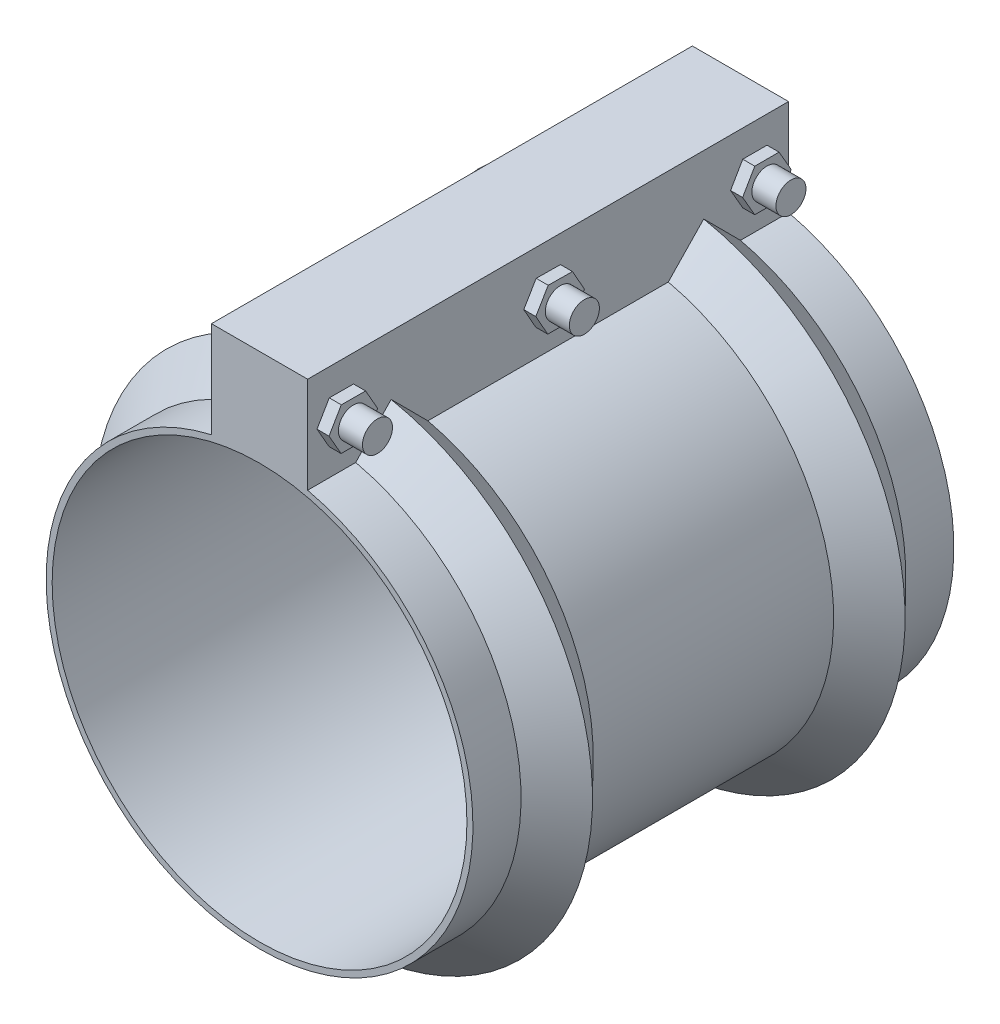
ISO-10303-21;
HEADER;
FILE_DESCRIPTION(('STEP AP214'),'2;1');
FILE_NAME('part.step','',(''),(''),'','','');
FILE_SCHEMA(('AUTOMOTIVE_DESIGN { 1 0 10303 214 1 1 1 1 }'));
ENDSEC;
DATA;
#1=APPLICATION_CONTEXT('core data for automotive mechanical design processes');
#2=APPLICATION_PROTOCOL_DEFINITION('international standard','automotive_design',2000,#1);
#3=PRODUCT_CONTEXT('',#1,'mechanical');
#4=PRODUCT('Part','Part','',(#3));
#5=PRODUCT_RELATED_PRODUCT_CATEGORY('part','',(#4));
#6=PRODUCT_DEFINITION_FORMATION('','',#4);
#7=PRODUCT_DEFINITION_CONTEXT('part definition',#1,'design');
#8=PRODUCT_DEFINITION('design','',#6,#7);
#9=PRODUCT_DEFINITION_SHAPE('','',#8);
#10=(LENGTH_UNIT() NAMED_UNIT(*) SI_UNIT(.MILLI.,.METRE.));
#11=(NAMED_UNIT(*) PLANE_ANGLE_UNIT() SI_UNIT($,.RADIAN.));
#12=(NAMED_UNIT(*) SI_UNIT($,.STERADIAN.) SOLID_ANGLE_UNIT());
#13=UNCERTAINTY_MEASURE_WITH_UNIT(LENGTH_MEASURE(1.E-05),#10,'distance_accuracy_value','');
#14=(GEOMETRIC_REPRESENTATION_CONTEXT(3) GLOBAL_UNCERTAINTY_ASSIGNED_CONTEXT((#13)) GLOBAL_UNIT_ASSIGNED_CONTEXT((#10,
#11,#12)) REPRESENTATION_CONTEXT('',''));
#15=CARTESIAN_POINT('',(0.,0.,0.));
#16=DIRECTION('',(0.,0.,1.));
#17=DIRECTION('',(1.,0.,0.));
#18=AXIS2_PLACEMENT_3D('',#15,#16,#17);
#19=CARTESIAN_POINT('',(25.4,160.61323989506,-127.));
#20=DIRECTION('',(1.,0.,0.));
#21=DIRECTION('',(0.,1.,0.));
#22=AXIS2_PLACEMENT_3D('',#19,#20,#21);
#23=PLANE('',#22);
#24=CARTESIAN_POINT('',(25.4,158.523974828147,54.6467952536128));
#25=CARTESIAN_POINT('',(25.4,155.315053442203,57.7569426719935));
#26=CARTESIAN_POINT('',(25.4,152.104997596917,60.8659207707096));
#27=CARTESIAN_POINT('',(25.4,145.682032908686,67.0809282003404));
#28=CARTESIAN_POINT('',(25.4,142.469124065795,70.1869575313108));
#29=CARTESIAN_POINT('',(25.4,136.039917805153,76.3954104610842));
#30=CARTESIAN_POINT('',(25.4,132.823620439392,79.4978341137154));
#31=CARTESIAN_POINT('',(25.4,126.386776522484,85.698274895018));
#32=CARTESIAN_POINT('',(25.4,123.166229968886,88.7962920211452));
#33=CARTESIAN_POINT('',(25.4,116.719773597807,94.9868300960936));
#34=CARTESIAN_POINT('',(25.4,113.493863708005,98.07935096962));
#35=CARTESIAN_POINT('',(25.4,107.035271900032,104.257306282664));
#36=CARTESIAN_POINT('',(25.4,103.802589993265,107.342740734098));
#37=CARTESIAN_POINT('',(25.4,98.9469004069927,111.963938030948));
#38=CARTESIAN_POINT('',(25.4,97.3272133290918,113.503190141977));
#39=CARTESIAN_POINT('',(25.4,94.0852747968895,116.578990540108));
#40=CARTESIAN_POINT('',(25.4,92.4630233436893,118.115538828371));
#41=CARTESIAN_POINT('',(25.4,89.2155450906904,121.185507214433));
#42=CARTESIAN_POINT('',(25.4,87.5903182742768,122.718927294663));
#43=CARTESIAN_POINT('',(25.4,84.3363672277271,125.782056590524));
#44=CARTESIAN_POINT('',(25.4,82.7076429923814,127.31176580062));
#45=CARTESIAN_POINT('',(25.4,81.0769069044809,128.839330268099));
#46=B_SPLINE_CURVE_WITH_KNOTS('',3,(#24,#25,#26,#27,#28,#29,#30,#31,#32,#33,#34,#35,#36,#37,#38,
#39,#40,#41,#42,#43,#44,#45),.UNSPECIFIED.,.F.,.F.,(4,2,2,2,2,2,2,2,2,2,4),(0.,13.4064076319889,
26.8128150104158,40.2190196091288,53.6252319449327,67.0316265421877,80.4379985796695,
87.1412900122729,93.8445785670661,100.547904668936,107.251240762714),.UNSPECIFIED.);
#47=CARTESIAN_POINT('',(25.4,129.291130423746,82.900574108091));
#48=VERTEX_POINT('',#47);
#49=CARTESIAN_POINT('',(25.4,109.81323989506,101.6));
#50=VERTEX_POINT('',#49);
#51=EDGE_CURVE('E402',#48,#50,#46,.T.);
#52=ORIENTED_EDGE('',*,*,#51,.F.);
#53=CARTESIAN_POINT('',(25.4,73.7907214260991,28.1708205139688));
#54=CARTESIAN_POINT('',(25.4,74.6025833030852,28.9528730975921));
#55=CARTESIAN_POINT('',(25.4,75.4137659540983,29.7356302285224));
#56=CARTESIAN_POINT('',(25.4,77.0348815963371,31.3024367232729));
#57=CARTESIAN_POINT('',(25.4,77.8448145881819,32.0864860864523));
#58=CARTESIAN_POINT('',(25.4,80.2728992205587,34.4403942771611));
#59=CARTESIAN_POINT('',(25.4,81.8893407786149,36.0120173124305));
#60=CARTESIAN_POINT('',(25.4,85.1183582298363,39.1591983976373));
#61=CARTESIAN_POINT('',(25.4,86.7309341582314,40.7347564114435));
#62=CARTESIAN_POINT('',(25.4,89.9527990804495,43.8892312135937));
#63=CARTESIAN_POINT('',(25.4,91.5620880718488,45.4681480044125));
#64=CARTESIAN_POINT('',(25.4,96.3856636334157,50.2091135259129));
#65=CARTESIAN_POINT('',(25.4,99.5957346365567,53.3754514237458));
#66=CARTESIAN_POINT('',(25.4,106.007428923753,59.7166800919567));
#67=CARTESIAN_POINT('',(25.4,109.20905218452,62.8915708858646));
#68=CARTESIAN_POINT('',(25.4,115.605683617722,69.2478723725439));
#69=CARTESIAN_POINT('',(25.4,118.800691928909,72.4292829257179));
#70=CARTESIAN_POINT('',(25.4,125.185542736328,78.7972757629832));
#71=CARTESIAN_POINT('',(25.4,128.37538523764,81.9838580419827));
#72=CARTESIAN_POINT('',(25.4,134.75099825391,88.3612353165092));
#73=CARTESIAN_POINT('',(25.4,137.936768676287,91.5520304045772));
#74=CARTESIAN_POINT('',(25.4,142.712891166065,96.3407496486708));
#75=CARTESIAN_POINT('',(25.4,144.304510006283,97.9374107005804));
#76=CARTESIAN_POINT('',(25.4,147.486978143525,101.131499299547));
#77=CARTESIAN_POINT('',(25.4,149.077827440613,102.728926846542));
#78=CARTESIAN_POINT('',(25.4,150.668329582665,104.326699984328));
#79=B_SPLINE_CURVE_WITH_KNOTS('',3,(#53,#54,#55,#56,#57,#58,#59,#60,#61,#62,#63,#64,#65,#66,#67,
#68,#69,#70,#71,#72,#73,#74,#75,#76,#77,#78),.UNSPECIFIED.,.F.,.F.,(4,2,2,2,2,2,2,2,2,2,2,2,4),
(0.,3.38179337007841,6.76358506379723,13.5271506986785,20.2906544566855,27.0541631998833,
40.580862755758,54.1075995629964,67.6340497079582,81.1604865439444,94.6872256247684,
101.450596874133,108.213967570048),.UNSPECIFIED.);
#80=CARTESIAN_POINT('',(25.4,109.81323989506,63.4934274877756));
#81=VERTEX_POINT('',#80);
#82=EDGE_CURVE('E397',#81,#48,#79,.T.);
#83=ORIENTED_EDGE('',*,*,#82,.F.);
#84=DIRECTION('',(0.,0.,1.));
#85=VECTOR('',#84,1.);
#86=CARTESIAN_POINT('',(25.4,109.81323989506,-127.));
#87=LINE('',#86,#85);
#88=CARTESIAN_POINT('',(25.4,109.81323989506,-63.4934274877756));
#89=VERTEX_POINT('',#88);
#90=EDGE_CURVE('E361',#89,#81,#87,.T.);
#91=ORIENTED_EDGE('',*,*,#90,.F.);
#92=CARTESIAN_POINT('',(25.4,158.523974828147,-110.446632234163));
#93=CARTESIAN_POINT('',(25.4,155.315053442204,-107.336484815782));
#94=CARTESIAN_POINT('',(25.4,152.104997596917,-104.227506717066));
#95=CARTESIAN_POINT('',(25.4,145.682032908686,-98.0124992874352));
#96=CARTESIAN_POINT('',(25.4,142.469124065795,-94.9064699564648));
#97=CARTESIAN_POINT('',(25.4,136.039917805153,-88.6980170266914));
#98=CARTESIAN_POINT('',(25.4,132.823620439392,-85.5955933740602));
#99=CARTESIAN_POINT('',(25.4,126.386776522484,-79.3951525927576));
#100=CARTESIAN_POINT('',(25.4,123.166229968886,-76.2971354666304));
#101=CARTESIAN_POINT('',(25.4,116.719773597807,-70.106597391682));
#102=CARTESIAN_POINT('',(25.4,113.493863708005,-67.0140765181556));
#103=CARTESIAN_POINT('',(25.4,107.035271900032,-60.8361212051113));
#104=CARTESIAN_POINT('',(25.4,103.802589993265,-57.7506867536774));
#105=CARTESIAN_POINT('',(25.4,98.9469004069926,-53.1294894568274));
#106=CARTESIAN_POINT('',(25.4,97.3272133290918,-51.5902373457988));
#107=CARTESIAN_POINT('',(25.4,94.0852747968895,-48.5144369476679));
#108=CARTESIAN_POINT('',(25.4,92.4630233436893,-46.977888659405));
#109=CARTESIAN_POINT('',(25.4,89.2155450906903,-43.9079202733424));
#110=CARTESIAN_POINT('',(25.4,87.5903182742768,-42.3745001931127));
#111=CARTESIAN_POINT('',(25.4,84.3363672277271,-39.311370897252));
#112=CARTESIAN_POINT('',(25.4,82.7076429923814,-37.7816616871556));
#113=CARTESIAN_POINT('',(25.4,81.0769069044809,-36.2540972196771));
#114=B_SPLINE_CURVE_WITH_KNOTS('',3,(#92,#93,#94,#95,#96,#97,#98,#99,#100,#101,#102,#103,#104,
#105,#106,#107,#108,#109,#110,#111,#112,#113),.UNSPECIFIED.,.F.,.F.,(4,2,2,2,2,2,2,2,2,2,4),(0.,
13.4064076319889,26.8128150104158,40.2190196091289,53.6252319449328,67.0316265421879,
80.4379985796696,87.141290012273,93.8445785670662,100.547904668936,107.251240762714),.UNSPECIFIED.);
#115=CARTESIAN_POINT('',(25.4,129.291130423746,-82.1928533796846));
#116=VERTEX_POINT('',#115);
#117=EDGE_CURVE('E373',#116,#89,#114,.T.);
#118=ORIENTED_EDGE('',*,*,#117,.F.);
#119=CARTESIAN_POINT('',(25.4,73.790721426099,-136.922606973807));
#120=CARTESIAN_POINT('',(25.4,74.6025833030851,-136.140554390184));
#121=CARTESIAN_POINT('',(25.4,75.4137659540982,-135.357797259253));
#122=CARTESIAN_POINT('',(25.4,77.034881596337,-133.790990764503));
#123=CARTESIAN_POINT('',(25.4,77.8448145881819,-133.006941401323));
#124=CARTESIAN_POINT('',(25.4,80.2728992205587,-130.653033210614));
#125=CARTESIAN_POINT('',(25.4,81.8893407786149,-129.081410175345));
#126=CARTESIAN_POINT('',(25.4,85.1183582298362,-125.934229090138));
#127=CARTESIAN_POINT('',(25.4,86.7309341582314,-124.358671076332));
#128=CARTESIAN_POINT('',(25.4,89.9527990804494,-121.204196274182));
#129=CARTESIAN_POINT('',(25.4,91.5620880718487,-119.625279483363));
#130=CARTESIAN_POINT('',(25.4,96.3856636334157,-114.884313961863));
#131=CARTESIAN_POINT('',(25.4,99.5957346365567,-111.71797606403));
#132=CARTESIAN_POINT('',(25.4,106.007428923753,-105.376747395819));
#133=CARTESIAN_POINT('',(25.4,109.20905218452,-102.201856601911));
#134=CARTESIAN_POINT('',(25.4,115.605683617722,-95.8455551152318));
#135=CARTESIAN_POINT('',(25.4,118.800691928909,-92.6641445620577));
#136=CARTESIAN_POINT('',(25.4,125.185542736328,-86.2961517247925));
#137=CARTESIAN_POINT('',(25.4,128.37538523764,-83.1095694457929));
#138=CARTESIAN_POINT('',(25.4,134.75099825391,-76.7321921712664));
#139=CARTESIAN_POINT('',(25.4,137.936768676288,-73.5413970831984));
#140=CARTESIAN_POINT('',(25.4,142.712891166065,-68.7526778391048));
#141=CARTESIAN_POINT('',(25.4,144.304510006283,-67.1560167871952));
#142=CARTESIAN_POINT('',(25.4,147.486978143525,-63.9619281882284));
#143=CARTESIAN_POINT('',(25.4,149.077827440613,-62.3645006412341));
#144=CARTESIAN_POINT('',(25.4,150.668329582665,-60.7667275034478));
#145=B_SPLINE_CURVE_WITH_KNOTS('',3,(#119,#120,#121,#122,#123,#124,#125,#126,#127,#128,#129,
#130,#131,#132,#133,#134,#135,#136,#137,#138,#139,#140,#141,#142,#143,#144),.UNSPECIFIED.,.F.,
.F.,(4,2,2,2,2,2,2,2,2,2,2,2,4),(0.,3.38179337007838,6.76358506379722,13.5271506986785,
20.2906544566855,27.0541631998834,40.5808627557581,54.1075995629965,67.6340497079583,
81.1604865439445,94.6872256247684,101.450596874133,108.213967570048),.UNSPECIFIED.);
#146=CARTESIAN_POINT('',(25.4,109.81323989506,-101.6));
#147=VERTEX_POINT('',#146);
#148=EDGE_CURVE('E356',#147,#116,#145,.T.);
#149=ORIENTED_EDGE('',*,*,#148,.F.);
#150=CARTESIAN_POINT('',(25.4,109.81323989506,-127.));
#151=VERTEX_POINT('',#150);
#152=EDGE_CURVE('E359',#151,#147,#87,.T.);
#153=ORIENTED_EDGE('',*,*,#152,.F.);
#154=DIRECTION('',(0.,1.,0.));
#155=VECTOR('',#154,1.);
#156=CARTESIAN_POINT('',(25.4,160.61323989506,-127.));
#157=LINE('',#156,#155);
#158=CARTESIAN_POINT('',(25.4,160.61323989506,-127.));
#159=VERTEX_POINT('',#158);
#160=EDGE_CURVE('E347',#151,#159,#157,.T.);
#161=ORIENTED_EDGE('',*,*,#160,.T.);
#162=DIRECTION('',(0.,0.,1.));
#163=VECTOR('',#162,1.);
#164=CARTESIAN_POINT('',(25.4,160.61323989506,-127.));
#165=LINE('',#164,#163);
#166=CARTESIAN_POINT('',(25.4,160.61323989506,127.));
#167=VERTEX_POINT('',#166);
#168=EDGE_CURVE('E357',#159,#167,#165,.T.);
#169=ORIENTED_EDGE('',*,*,#168,.T.);
#170=DIRECTION('',(0.,1.,0.));
#171=VECTOR('',#170,1.);
#172=CARTESIAN_POINT('',(25.4,160.61323989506,127.));
#173=LINE('',#172,#171);
#174=CARTESIAN_POINT('',(25.4,109.81323989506,127.));
#175=VERTEX_POINT('',#174);
#176=EDGE_CURVE('E338',#175,#167,#173,.T.);
#177=ORIENTED_EDGE('',*,*,#176,.F.);
#178=EDGE_CURVE('E362',#50,#175,#87,.T.);
#179=ORIENTED_EDGE('',*,*,#178,.F.);
#180=EDGE_LOOP('',(#52,#83,#91,#118,#149,#153,#161,#169,#177,#179));
#181=FACE_BOUND('',#180,.T.);
#182=DIRECTION('',(0.,0.86859990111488,0.49551408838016));
#183=VECTOR('',#182,1.);
#184=CARTESIAN_POINT('',(25.4,135.146872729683,96.3885618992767));
#185=LINE('',#184,#183);
#186=CARTESIAN_POINT('',(25.4,135.146872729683,96.3885618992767));
#187=VERTEX_POINT('',#186);
#188=CARTESIAN_POINT('',(25.4,146.292407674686,102.746805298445));
#189=VERTEX_POINT('',#188);
#190=EDGE_CURVE('E310',#187,#189,#185,.T.);
#191=ORIENTED_EDGE('',*,*,#190,.F.);
#192=DIRECTION('',(0.,0.863427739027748,-0.504472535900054));
#193=VECTOR('',#192,1.);
#194=CARTESIAN_POINT('',(25.4,124.067704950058,102.861756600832));
#195=LINE('',#194,#193);
#196=CARTESIAN_POINT('',(25.4,124.067704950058,102.861756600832));
#197=VERTEX_POINT('',#196);
#198=EDGE_CURVE('E292',#197,#187,#195,.T.);
#199=ORIENTED_EDGE('',*,*,#198,.F.);
#200=DIRECTION('',(0.,-0.00517216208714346,-0.999986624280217));
#201=VECTOR('',#200,1.);
#202=CARTESIAN_POINT('',(25.4,124.134072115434,115.693194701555));
#203=LINE('',#202,#201);
#204=CARTESIAN_POINT('',(25.4,124.134072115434,115.693194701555));
#205=VERTEX_POINT('',#204);
#206=EDGE_CURVE('E297',#205,#197,#203,.T.);
#207=ORIENTED_EDGE('',*,*,#206,.F.);
#208=DIRECTION('',(0.,-0.86859990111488,-0.49551408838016));
#209=VECTOR('',#208,1.);
#210=CARTESIAN_POINT('',(25.4,135.279607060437,122.051438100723));
#211=LINE('',#210,#209);
#212=CARTESIAN_POINT('',(25.4,135.279607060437,122.051438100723));
#213=VERTEX_POINT('',#212);
#214=EDGE_CURVE('E316',#213,#205,#211,.T.);
#215=ORIENTED_EDGE('',*,*,#214,.F.);
#216=DIRECTION('',(0.,-0.863427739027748,0.504472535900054));
#217=VECTOR('',#216,1.);
#218=CARTESIAN_POINT('',(25.4,146.358774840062,115.578243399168));
#219=LINE('',#218,#217);
#220=CARTESIAN_POINT('',(25.4,146.358774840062,115.578243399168));
#221=VERTEX_POINT('',#220);
#222=EDGE_CURVE('E314',#221,#213,#219,.T.);
#223=ORIENTED_EDGE('',*,*,#222,.F.);
#224=DIRECTION('',(0.,0.00517216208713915,0.999986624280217));
#225=VECTOR('',#224,1.);
#226=CARTESIAN_POINT('',(25.4,146.292407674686,102.746805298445));
#227=LINE('',#226,#225);
#228=EDGE_CURVE('E312',#189,#221,#227,.T.);
#229=ORIENTED_EDGE('',*,*,#228,.F.);
#230=EDGE_LOOP('',(#191,#199,#207,#215,#223,#229));
#231=FACE_BOUND('',#230,.T.);
#232=DIRECTION('',(0.,0.871288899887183,0.490770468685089));
#233=VECTOR('',#232,1.);
#234=CARTESIAN_POINT('',(25.4,135.076907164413,-12.8308854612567));
#235=LINE('',#234,#233);
#236=CARTESIAN_POINT('',(25.4,135.076907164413,-12.8308854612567));
#237=VERTEX_POINT('',#236);
#238=CARTESIAN_POINT('',(25.4,146.256946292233,-6.53351033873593));
#239=VERTEX_POINT('',#238);
#240=EDGE_CURVE('E249',#237,#239,#235,.T.);
#241=ORIENTED_EDGE('',*,*,#240,.F.);
#242=DIRECTION('',(0.,0.860664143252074,-0.509173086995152));
#243=VECTOR('',#242,1.);
#244=CARTESIAN_POINT('',(25.4,124.03320076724,-6.2973751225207));
#245=LINE('',#244,#243);
#246=CARTESIAN_POINT('',(25.4,124.03320076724,-6.2973751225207));
#247=VERTEX_POINT('',#246);
#248=EDGE_CURVE('E246',#247,#237,#245,.T.);
#249=ORIENTED_EDGE('',*,*,#248,.F.);
#250=DIRECTION('',(0.,-0.0106247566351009,-0.999943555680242));
#251=VECTOR('',#250,1.);
#252=CARTESIAN_POINT('',(25.4,124.169533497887,6.533510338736));
#253=LINE('',#252,#251);
#254=CARTESIAN_POINT('',(25.4,124.169533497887,6.53351033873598));
#255=VERTEX_POINT('',#254);
#256=EDGE_CURVE('E259',#255,#247,#253,.T.);
#257=ORIENTED_EDGE('',*,*,#256,.F.);
#258=DIRECTION('',(0.,-0.871288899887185,-0.490770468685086));
#259=VECTOR('',#258,1.);
#260=CARTESIAN_POINT('',(25.4,135.349572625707,12.8308854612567));
#261=LINE('',#260,#259);
#262=CARTESIAN_POINT('',(25.4,135.349572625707,12.8308854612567));
#263=VERTEX_POINT('',#262);
#264=EDGE_CURVE('E275',#263,#255,#261,.T.);
#265=ORIENTED_EDGE('',*,*,#264,.F.);
#266=DIRECTION('',(0.,-0.860664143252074,0.509173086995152));
#267=VECTOR('',#266,1.);
#268=CARTESIAN_POINT('',(25.4,146.39327902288,6.29737512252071));
#269=LINE('',#268,#267);
#270=CARTESIAN_POINT('',(25.4,146.39327902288,6.29737512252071));
#271=VERTEX_POINT('',#270);
#272=EDGE_CURVE('E273',#271,#263,#269,.T.);
#273=ORIENTED_EDGE('',*,*,#272,.F.);
#274=DIRECTION('',(0.,0.0106247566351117,0.999943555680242));
#275=VECTOR('',#274,1.);
#276=CARTESIAN_POINT('',(25.4,146.256946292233,-6.53351033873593));
#277=LINE('',#276,#275);
#278=EDGE_CURVE('E271',#239,#271,#277,.T.);
#279=ORIENTED_EDGE('',*,*,#278,.F.);
#280=EDGE_LOOP('',(#241,#249,#257,#265,#273,#279));
#281=FACE_BOUND('',#280,.T.);
#282=DIRECTION('',(0.,0.866025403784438,0.500000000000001));
#283=VECTOR('',#282,1.);
#284=CARTESIAN_POINT('',(25.4,135.21323989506,-122.05160973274));
#285=LINE('',#284,#283);
#286=CARTESIAN_POINT('',(25.4,135.21323989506,-122.05160973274));
#287=VERTEX_POINT('',#286);
#288=CARTESIAN_POINT('',(25.4,146.32573989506,-115.63580486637));
#289=VERTEX_POINT('',#288);
#290=EDGE_CURVE('E531',#287,#289,#285,.T.);
#291=ORIENTED_EDGE('',*,*,#290,.F.);
#292=DIRECTION('',(0.,0.866025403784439,-0.5));
#293=VECTOR('',#292,1.);
#294=CARTESIAN_POINT('',(25.4,124.10073989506,-115.63580486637));
#295=LINE('',#294,#293);
#296=CARTESIAN_POINT('',(25.4,124.10073989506,-115.63580486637));
#297=VERTEX_POINT('',#296);
#298=EDGE_CURVE('E244',#297,#287,#295,.T.);
#299=ORIENTED_EDGE('',*,*,#298,.F.);
#300=DIRECTION('',(0.,0.,-1.));
#301=VECTOR('',#300,1.);
#302=CARTESIAN_POINT('',(25.4,124.10073989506,-102.80419513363));
#303=LINE('',#302,#301);
#304=CARTESIAN_POINT('',(25.4,124.10073989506,-102.80419513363));
#305=VERTEX_POINT('',#304);
#306=EDGE_CURVE('E240',#305,#297,#303,.T.);
#307=ORIENTED_EDGE('',*,*,#306,.F.);
#308=DIRECTION('',(0.,-0.866025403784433,-0.50000000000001));
#309=VECTOR('',#308,1.);
#310=CARTESIAN_POINT('',(25.4,135.21323989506,-96.3883902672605));
#311=LINE('',#310,#309);
#312=CARTESIAN_POINT('',(25.4,135.21323989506,-96.3883902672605));
#313=VERTEX_POINT('',#312);
#314=EDGE_CURVE('E537',#313,#305,#311,.T.);
#315=ORIENTED_EDGE('',*,*,#314,.F.);
#316=DIRECTION('',(0.,-0.866025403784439,0.5));
#317=VECTOR('',#316,1.);
#318=CARTESIAN_POINT('',(25.4,146.32573989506,-102.80419513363));
#319=LINE('',#318,#317);
#320=CARTESIAN_POINT('',(25.4,146.32573989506,-102.80419513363));
#321=VERTEX_POINT('',#320);
#322=EDGE_CURVE('E535',#321,#313,#319,.T.);
#323=ORIENTED_EDGE('',*,*,#322,.F.);
#324=DIRECTION('',(0.,0.,1.));
#325=VECTOR('',#324,1.);
#326=CARTESIAN_POINT('',(25.4,146.32573989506,-115.63580486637));
#327=LINE('',#326,#325);
#328=EDGE_CURVE('E533',#289,#321,#327,.T.);
#329=ORIENTED_EDGE('',*,*,#328,.F.);
#330=EDGE_LOOP('',(#291,#299,#307,#315,#323,#329));
#331=FACE_BOUND('',#330,.T.);
#332=ADVANCED_FACE('F35',(#181,#231,#281,#331),#23,.T.);
#333=CARTESIAN_POINT('',(0.,109.5375,127.));
#334=DIRECTION('',(0.,0.,-1.));
#335=DIRECTION('',(-1.,0.,0.));
#336=AXIS2_PLACEMENT_3D('',#333,#334,#335);
#337=PLANE('',#336);
#338=CARTESIAN_POINT('',(0.,0.,127.));
#339=DIRECTION('',(0.,0.,1.));
#340=DIRECTION('',(1.,0.,0.));
#341=AXIS2_PLACEMENT_3D('',#338,#339,#340);
#342=CIRCLE('',#341,109.5375);
#343=CARTESIAN_POINT('',(109.5375,0.,127.));
#344=VERTEX_POINT('',#343);
#345=EDGE_CURVE('E434',#344,#344,#342,.T.);
#346=ORIENTED_EDGE('',*,*,#345,.F.);
#347=EDGE_LOOP('',(#346));
#348=FACE_BOUND('',#347,.T.);
#349=CARTESIAN_POINT('',(0.,0.,127.));
#350=DIRECTION('',(0.,0.,1.));
#351=DIRECTION('',(1.,0.,0.));
#352=AXIS2_PLACEMENT_3D('',#349,#350,#351);
#353=CIRCLE('',#352,112.7125);
#354=CARTESIAN_POINT('',(-25.4,109.81323989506,127.));
#355=VERTEX_POINT('',#354);
#356=EDGE_CURVE('E460',#355,#175,#353,.T.);
#357=ORIENTED_EDGE('',*,*,#356,.T.);
#358=ORIENTED_EDGE('',*,*,#176,.T.);
#359=DIRECTION('',(-1.,0.,0.));
#360=VECTOR('',#359,1.);
#361=CARTESIAN_POINT('',(-25.4,160.61323989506,127.));
#362=LINE('',#361,#360);
#363=CARTESIAN_POINT('',(-25.4,160.61323989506,127.));
#364=VERTEX_POINT('',#363);
#365=EDGE_CURVE('E341',#167,#364,#362,.T.);
#366=ORIENTED_EDGE('',*,*,#365,.T.);
#367=DIRECTION('',(0.,-1.,0.));
#368=VECTOR('',#367,1.);
#369=CARTESIAN_POINT('',(-25.4,160.61323989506,127.));
#370=LINE('',#369,#368);
#371=EDGE_CURVE('E335',#364,#355,#370,.T.);
#372=ORIENTED_EDGE('',*,*,#371,.T.);
#373=EDGE_LOOP('',(#357,#358,#366,#372));
#374=FACE_BOUND('',#373,.T.);
#375=ADVANCED_FACE('F386',(#348,#374),#337,.F.);
#376=CARTESIAN_POINT('',(0.,0.,248.174311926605));
#377=DIRECTION('',(0.,0.,1.));
#378=DIRECTION('',(1.,0.,0.));
#379=AXIS2_PLACEMENT_3D('',#376,#377,#378);
#380=CYLINDRICAL_SURFACE('',#379,112.7125);
#381=ORIENTED_EDGE('',*,*,#356,.F.);
#382=DIRECTION('',(0.,0.,1.));
#383=VECTOR('',#382,1.);
#384=CARTESIAN_POINT('',(-25.4,109.81323989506,-127.));
#385=LINE('',#384,#383);
#386=CARTESIAN_POINT('',(-25.4,109.81323989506,101.6));
#387=VERTEX_POINT('',#386);
#388=EDGE_CURVE('E353',#387,#355,#385,.T.);
#389=ORIENTED_EDGE('',*,*,#388,.F.);
#390=CARTESIAN_POINT('',(0.,0.,101.6));
#391=DIRECTION('',(0.,0.,1.));
#392=DIRECTION('',(1.,0.,0.));
#393=AXIS2_PLACEMENT_3D('',#390,#391,#392);
#394=CIRCLE('',#393,112.7125);
#395=EDGE_CURVE('E457',#387,#50,#394,.T.);
#396=ORIENTED_EDGE('',*,*,#395,.T.);
#397=ORIENTED_EDGE('',*,*,#178,.T.);
#398=EDGE_LOOP('',(#381,#389,#396,#397));
#399=FACE_BOUND('',#398,.T.);
#400=ADVANCED_FACE('F698',(#399),#380,.T.);
#401=CARTESIAN_POINT('',(0.,0.,82.900574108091));
#402=DIRECTION('',(0.,0.,-1.));
#403=DIRECTION('',(-1.,0.,0.));
#404=AXIS2_PLACEMENT_3D('',#401,#402,#403);
#405=CONICAL_SURFACE('',#404,131.7625,0.794684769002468);
#406=ORIENTED_EDGE('',*,*,#395,.F.);
#407=CARTESIAN_POINT('',(-25.4,81.0769069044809,128.839330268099));
#408=CARTESIAN_POINT('',(-25.4,82.7076429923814,127.31176580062));
#409=CARTESIAN_POINT('',(-25.4,84.3363672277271,125.782056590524));
#410=CARTESIAN_POINT('',(-25.4,87.5903182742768,122.718927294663));
#411=CARTESIAN_POINT('',(-25.4,89.2155450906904,121.185507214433));
#412=CARTESIAN_POINT('',(-25.4,92.4630233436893,118.115538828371));
#413=CARTESIAN_POINT('',(-25.4,94.0852747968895,116.578990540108));
#414=CARTESIAN_POINT('',(-25.4,97.3272133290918,113.503190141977));
#415=CARTESIAN_POINT('',(-25.4,98.9469004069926,111.963938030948));
#416=CARTESIAN_POINT('',(-25.4,103.802589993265,107.342740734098));
#417=CARTESIAN_POINT('',(-25.4,107.035271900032,104.257306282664));
#418=CARTESIAN_POINT('',(-25.4,113.493863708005,98.0793509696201));
#419=CARTESIAN_POINT('',(-25.4,116.719773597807,94.9868300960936));
#420=CARTESIAN_POINT('',(-25.4,123.166229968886,88.7962920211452));
#421=CARTESIAN_POINT('',(-25.4,126.386776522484,85.698274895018));
#422=CARTESIAN_POINT('',(-25.4,132.823620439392,79.4978341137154));
#423=CARTESIAN_POINT('',(-25.4,136.039917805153,76.3954104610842));
#424=CARTESIAN_POINT('',(-25.4,142.469124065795,70.1869575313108));
#425=CARTESIAN_POINT('',(-25.4,145.682032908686,67.0809282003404));
#426=CARTESIAN_POINT('',(-25.4,152.104997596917,60.8659207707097));
#427=CARTESIAN_POINT('',(-25.4,155.315053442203,57.7569426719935));
#428=CARTESIAN_POINT('',(-25.4,158.523974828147,54.6467952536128));
#429=B_SPLINE_CURVE_WITH_KNOTS('',3,(#407,#408,#409,#410,#411,#412,#413,#414,#415,#416,#417,
#418,#419,#420,#421,#422,#423,#424,#425,#426,#427,#428),.UNSPECIFIED.,.F.,.F.,(4,2,2,2,2,2,2,2,
2,2,4),(0.,6.70333609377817,13.4066621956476,20.1099507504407,26.8132421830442,40.2196142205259,
53.6260088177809,67.0322211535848,80.4384257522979,93.8448331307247,107.251240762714),.UNSPECIFIED.);
#430=CARTESIAN_POINT('',(-25.4,129.291130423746,82.900574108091));
#431=VERTEX_POINT('',#430);
#432=EDGE_CURVE('E425',#387,#431,#429,.T.);
#433=ORIENTED_EDGE('',*,*,#432,.T.);
#434=CARTESIAN_POINT('',(0.,0.,82.900574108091));
#435=DIRECTION('',(0.,0.,1.));
#436=DIRECTION('',(1.,0.,0.));
#437=AXIS2_PLACEMENT_3D('',#434,#435,#436);
#438=CIRCLE('',#437,131.7625);
#439=EDGE_CURVE('E454',#431,#48,#438,.T.);
#440=ORIENTED_EDGE('',*,*,#439,.T.);
#441=ORIENTED_EDGE('',*,*,#51,.T.);
#442=EDGE_LOOP('',(#406,#433,#440,#441));
#443=FACE_BOUND('',#442,.T.);
#444=ADVANCED_FACE('F413',(#443),#405,.T.);
#445=CARTESIAN_POINT('',(0.,0.,63.4934274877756));
#446=DIRECTION('',(0.,0.,1.));
#447=DIRECTION('',(1.,0.,0.));
#448=AXIS2_PLACEMENT_3D('',#445,#446,#447);
#449=CONICAL_SURFACE('',#448,112.7125,0.776111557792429);
#450=ORIENTED_EDGE('',*,*,#439,.F.);
#451=CARTESIAN_POINT('',(-25.4,150.668329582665,104.326699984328));
#452=CARTESIAN_POINT('',(-25.4,149.077827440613,102.728926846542));
#453=CARTESIAN_POINT('',(-25.4,147.486978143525,101.131499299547));
#454=CARTESIAN_POINT('',(-25.4,144.304510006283,97.9374107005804));
#455=CARTESIAN_POINT('',(-25.4,142.712891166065,96.3407496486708));
#456=CARTESIAN_POINT('',(-25.4,137.936768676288,91.5520304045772));
#457=CARTESIAN_POINT('',(-25.4,134.75099825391,88.3612353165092));
#458=CARTESIAN_POINT('',(-25.4,128.37538523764,81.9838580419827));
#459=CARTESIAN_POINT('',(-25.4,125.185542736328,78.7972757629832));
#460=CARTESIAN_POINT('',(-25.4,118.800691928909,72.4292829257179));
#461=CARTESIAN_POINT('',(-25.4,115.605683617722,69.2478723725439));
#462=CARTESIAN_POINT('',(-25.4,109.20905218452,62.8915708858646));
#463=CARTESIAN_POINT('',(-25.4,106.007428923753,59.7166800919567));
#464=CARTESIAN_POINT('',(-25.4,99.5957346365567,53.3754514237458));
#465=CARTESIAN_POINT('',(-25.4,96.3856636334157,50.2091135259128));
#466=CARTESIAN_POINT('',(-25.4,91.5620880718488,45.4681480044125));
#467=CARTESIAN_POINT('',(-25.4,89.9527990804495,43.8892312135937));
#468=CARTESIAN_POINT('',(-25.4,86.7309341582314,40.7347564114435));
#469=CARTESIAN_POINT('',(-25.4,85.1183582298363,39.1591983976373));
#470=CARTESIAN_POINT('',(-25.4,81.8893407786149,36.0120173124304));
#471=CARTESIAN_POINT('',(-25.4,80.2728992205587,34.4403942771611));
#472=CARTESIAN_POINT('',(-25.4,77.8448145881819,32.0864860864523));
#473=CARTESIAN_POINT('',(-25.4,77.0348815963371,31.3024367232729));
#474=CARTESIAN_POINT('',(-25.4,75.4137659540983,29.7356302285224));
#475=CARTESIAN_POINT('',(-25.4,74.6025833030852,28.9528730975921));
#476=CARTESIAN_POINT('',(-25.4,73.7907214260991,28.1708205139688));
#477=B_SPLINE_CURVE_WITH_KNOTS('',3,(#451,#452,#453,#454,#455,#456,#457,#458,#459,#460,#461,
#462,#463,#464,#465,#466,#467,#468,#469,#470,#471,#472,#473,#474,#475,#476),.UNSPECIFIED.,.F.,
.F.,(4,2,2,2,2,2,2,2,2,2,2,2,4),(0.,6.76337069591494,13.5267419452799,27.0534810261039,
40.5799178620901,54.1063680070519,67.6331048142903,81.159804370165,87.9233131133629,
94.6868168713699,101.450382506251,104.83217419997,108.213967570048),.UNSPECIFIED.);
#478=CARTESIAN_POINT('',(-25.4,109.81323989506,63.4934274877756));
#479=VERTEX_POINT('',#478);
#480=EDGE_CURVE('E419',#431,#479,#477,.T.);
#481=ORIENTED_EDGE('',*,*,#480,.T.);
#482=CARTESIAN_POINT('',(0.,0.,63.4934274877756));
#483=DIRECTION('',(0.,0.,1.));
#484=DIRECTION('',(1.,0.,0.));
#485=AXIS2_PLACEMENT_3D('',#482,#483,#484);
#486=CIRCLE('',#485,112.7125);
#487=EDGE_CURVE('E451',#479,#81,#486,.T.);
#488=ORIENTED_EDGE('',*,*,#487,.T.);
#489=ORIENTED_EDGE('',*,*,#82,.T.);
#490=EDGE_LOOP('',(#450,#481,#488,#489));
#491=FACE_BOUND('',#490,.T.);
#492=ADVANCED_FACE('F408',(#491),#449,.T.);
#493=CARTESIAN_POINT('',(0.,0.,248.174311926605));
#494=DIRECTION('',(0.,0.,1.));
#495=DIRECTION('',(1.,0.,0.));
#496=AXIS2_PLACEMENT_3D('',#493,#494,#495);
#497=CYLINDRICAL_SURFACE('',#496,112.7125);
#498=ORIENTED_EDGE('',*,*,#487,.F.);
#499=CARTESIAN_POINT('',(-25.4,109.81323989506,-63.4934274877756));
#500=VERTEX_POINT('',#499);
#501=EDGE_CURVE('E366',#500,#479,#385,.T.);
#502=ORIENTED_EDGE('',*,*,#501,.F.);
#503=CARTESIAN_POINT('',(0.,0.,-63.4934274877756));
#504=DIRECTION('',(0.,0.,1.));
#505=DIRECTION('',(1.,0.,0.));
#506=AXIS2_PLACEMENT_3D('',#503,#504,#505);
#507=CIRCLE('',#506,112.7125);
#508=EDGE_CURVE('E448',#500,#89,#507,.T.);
#509=ORIENTED_EDGE('',*,*,#508,.T.);
#510=ORIENTED_EDGE('',*,*,#90,.T.);
#511=EDGE_LOOP('',(#498,#502,#509,#510));
#512=FACE_BOUND('',#511,.T.);
#513=ADVANCED_FACE('F412',(#512),#497,.T.);
#514=CARTESIAN_POINT('',(0.,0.,-82.1928533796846));
#515=DIRECTION('',(0.,0.,-1.));
#516=DIRECTION('',(-1.,0.,0.));
#517=AXIS2_PLACEMENT_3D('',#514,#515,#516);
#518=CONICAL_SURFACE('',#517,131.7625,0.794684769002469);
#519=ORIENTED_EDGE('',*,*,#508,.F.);
#520=CARTESIAN_POINT('',(-25.4,81.0769069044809,-36.2540972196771));
#521=CARTESIAN_POINT('',(-25.4,82.7076429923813,-37.7816616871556));
#522=CARTESIAN_POINT('',(-25.4,84.3363672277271,-39.311370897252));
#523=CARTESIAN_POINT('',(-25.4,87.5903182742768,-42.3745001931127));
#524=CARTESIAN_POINT('',(-25.4,89.2155450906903,-43.9079202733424));
#525=CARTESIAN_POINT('',(-25.4,92.4630233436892,-46.977888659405));
#526=CARTESIAN_POINT('',(-25.4,94.0852747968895,-48.5144369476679));
#527=CARTESIAN_POINT('',(-25.4,97.3272133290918,-51.5902373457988));
#528=CARTESIAN_POINT('',(-25.4,98.9469004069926,-53.1294894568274));
#529=CARTESIAN_POINT('',(-25.4,103.802589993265,-57.7506867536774));
#530=CARTESIAN_POINT('',(-25.4,107.035271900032,-60.8361212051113));
#531=CARTESIAN_POINT('',(-25.4,113.493863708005,-67.0140765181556));
#532=CARTESIAN_POINT('',(-25.4,116.719773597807,-70.106597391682));
#533=CARTESIAN_POINT('',(-25.4,123.166229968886,-76.2971354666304));
#534=CARTESIAN_POINT('',(-25.4,126.386776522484,-79.3951525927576));
#535=CARTESIAN_POINT('',(-25.4,132.823620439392,-85.5955933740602));
#536=CARTESIAN_POINT('',(-25.4,136.039917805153,-88.6980170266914));
#537=CARTESIAN_POINT('',(-25.4,142.469124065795,-94.9064699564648));
#538=CARTESIAN_POINT('',(-25.4,145.682032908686,-98.0124992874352));
#539=CARTESIAN_POINT('',(-25.4,152.104997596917,-104.227506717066));
#540=CARTESIAN_POINT('',(-25.4,155.315053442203,-107.336484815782));
#541=CARTESIAN_POINT('',(-25.4,158.523974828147,-110.446632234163));
#542=B_SPLINE_CURVE_WITH_KNOTS('',3,(#520,#521,#522,#523,#524,#525,#526,#527,#528,#529,#530,
#531,#532,#533,#534,#535,#536,#537,#538,#539,#540,#541),.UNSPECIFIED.,.F.,.F.,(4,2,2,2,2,2,2,2,
2,2,4),(0.,6.70333609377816,13.4066621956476,20.1099507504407,26.8132421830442,40.2196142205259,
53.626008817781,67.0322211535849,80.438425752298,93.8448331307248,107.251240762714),.UNSPECIFIED.);
#543=CARTESIAN_POINT('',(-25.4,129.291130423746,-82.1928533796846));
#544=VERTEX_POINT('',#543);
#545=EDGE_CURVE('E426',#500,#544,#542,.T.);
#546=ORIENTED_EDGE('',*,*,#545,.T.);
#547=CARTESIAN_POINT('',(0.,0.,-82.1928533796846));
#548=DIRECTION('',(0.,0.,1.));
#549=DIRECTION('',(1.,0.,0.));
#550=AXIS2_PLACEMENT_3D('',#547,#548,#549);
#551=CIRCLE('',#550,131.7625);
#552=EDGE_CURVE('E445',#544,#116,#551,.T.);
#553=ORIENTED_EDGE('',*,*,#552,.T.);
#554=ORIENTED_EDGE('',*,*,#117,.T.);
#555=EDGE_LOOP('',(#519,#546,#553,#554));
#556=FACE_BOUND('',#555,.T.);
#557=ADVANCED_FACE('F690',(#556),#518,.T.);
#558=CARTESIAN_POINT('',(0.,0.,-101.6));
#559=DIRECTION('',(0.,0.,1.));
#560=DIRECTION('',(1.,0.,0.));
#561=AXIS2_PLACEMENT_3D('',#558,#559,#560);
#562=CONICAL_SURFACE('',#561,112.7125,0.77611155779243);
#563=ORIENTED_EDGE('',*,*,#552,.F.);
#564=CARTESIAN_POINT('',(-25.4,150.668329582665,-60.7667275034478));
#565=CARTESIAN_POINT('',(-25.4,149.077827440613,-62.3645006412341));
#566=CARTESIAN_POINT('',(-25.4,147.486978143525,-63.9619281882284));
#567=CARTESIAN_POINT('',(-25.4,144.304510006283,-67.1560167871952));
#568=CARTESIAN_POINT('',(-25.4,142.712891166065,-68.7526778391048));
#569=CARTESIAN_POINT('',(-25.4,137.936768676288,-73.5413970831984));
#570=CARTESIAN_POINT('',(-25.4,134.75099825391,-76.7321921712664));
#571=CARTESIAN_POINT('',(-25.4,128.37538523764,-83.1095694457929));
#572=CARTESIAN_POINT('',(-25.4,125.185542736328,-86.2961517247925));
#573=CARTESIAN_POINT('',(-25.4,118.800691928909,-92.6641445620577));
#574=CARTESIAN_POINT('',(-25.4,115.605683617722,-95.8455551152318));
#575=CARTESIAN_POINT('',(-25.4,109.20905218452,-102.201856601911));
#576=CARTESIAN_POINT('',(-25.4,106.007428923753,-105.376747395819));
#577=CARTESIAN_POINT('',(-25.4,99.5957346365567,-111.71797606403));
#578=CARTESIAN_POINT('',(-25.4,96.3856636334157,-114.884313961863));
#579=CARTESIAN_POINT('',(-25.4,91.5620880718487,-119.625279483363));
#580=CARTESIAN_POINT('',(-25.4,89.9527990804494,-121.204196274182));
#581=CARTESIAN_POINT('',(-25.4,86.7309341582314,-124.358671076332));
#582=CARTESIAN_POINT('',(-25.4,85.1183582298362,-125.934229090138));
#583=CARTESIAN_POINT('',(-25.4,81.8893407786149,-129.081410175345));
#584=CARTESIAN_POINT('',(-25.4,80.2728992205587,-130.653033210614));
#585=CARTESIAN_POINT('',(-25.4,77.8448145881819,-133.006941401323));
#586=CARTESIAN_POINT('',(-25.4,77.034881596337,-133.790990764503));
#587=CARTESIAN_POINT('',(-25.4,75.4137659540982,-135.357797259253));
#588=CARTESIAN_POINT('',(-25.4,74.6025833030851,-136.140554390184));
#589=CARTESIAN_POINT('',(-25.4,73.790721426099,-136.922606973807));
#590=B_SPLINE_CURVE_WITH_KNOTS('',3,(#564,#565,#566,#567,#568,#569,#570,#571,#572,#573,#574,
#575,#576,#577,#578,#579,#580,#581,#582,#583,#584,#585,#586,#587,#588,#589),.UNSPECIFIED.,.F.,
.F.,(4,2,2,2,2,2,2,2,2,2,2,2,4),(0.,6.76337069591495,13.52674194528,27.0534810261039,
40.5799178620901,54.106368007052,67.6331048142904,81.159804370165,87.9233131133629,
94.6868168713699,101.450382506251,104.83217419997,108.213967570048),.UNSPECIFIED.);
#591=CARTESIAN_POINT('',(-25.4,109.81323989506,-101.6));
#592=VERTEX_POINT('',#591);
#593=EDGE_CURVE('E704',#544,#592,#590,.T.);
#594=ORIENTED_EDGE('',*,*,#593,.T.);
#595=CARTESIAN_POINT('',(0.,0.,-101.6));
#596=DIRECTION('',(0.,0.,1.));
#597=DIRECTION('',(1.,0.,0.));
#598=AXIS2_PLACEMENT_3D('',#595,#596,#597);
#599=CIRCLE('',#598,112.7125);
#600=EDGE_CURVE('E442',#592,#147,#599,.T.);
#601=ORIENTED_EDGE('',*,*,#600,.T.);
#602=ORIENTED_EDGE('',*,*,#148,.T.);
#603=EDGE_LOOP('',(#563,#594,#601,#602));
#604=FACE_BOUND('',#603,.T.);
#605=ADVANCED_FACE('F379',(#604),#562,.T.);
#606=CARTESIAN_POINT('',(0.,0.,248.174311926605));
#607=DIRECTION('',(0.,0.,1.));
#608=DIRECTION('',(1.,0.,0.));
#609=AXIS2_PLACEMENT_3D('',#606,#607,#608);
#610=CYLINDRICAL_SURFACE('',#609,112.7125);
#611=ORIENTED_EDGE('',*,*,#600,.F.);
#612=CARTESIAN_POINT('',(-25.4,109.81323989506,-127.));
#613=VERTEX_POINT('',#612);
#614=EDGE_CURVE('E363',#613,#592,#385,.T.);
#615=ORIENTED_EDGE('',*,*,#614,.F.);
#616=CARTESIAN_POINT('',(0.,0.,-127.));
#617=DIRECTION('',(0.,0.,1.));
#618=DIRECTION('',(1.,0.,0.));
#619=AXIS2_PLACEMENT_3D('',#616,#617,#618);
#620=CIRCLE('',#619,112.7125);
#621=EDGE_CURVE('E440',#613,#151,#620,.T.);
#622=ORIENTED_EDGE('',*,*,#621,.T.);
#623=ORIENTED_EDGE('',*,*,#152,.T.);
#624=EDGE_LOOP('',(#611,#615,#622,#623));
#625=FACE_BOUND('',#624,.T.);
#626=ADVANCED_FACE('F707',(#625),#610,.T.);
#627=CARTESIAN_POINT('',(0.,112.7125,-127.));
#628=DIRECTION('',(0.,0.,1.));
#629=DIRECTION('',(1.,0.,0.));
#630=AXIS2_PLACEMENT_3D('',#627,#628,#629);
#631=PLANE('',#630);
#632=ORIENTED_EDGE('',*,*,#621,.F.);
#633=DIRECTION('',(0.,-1.,0.));
#634=VECTOR('',#633,1.);
#635=CARTESIAN_POINT('',(-25.4,160.61323989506,-127.));
#636=LINE('',#635,#634);
#637=CARTESIAN_POINT('',(-25.4,160.61323989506,-127.));
#638=VERTEX_POINT('',#637);
#639=EDGE_CURVE('E344',#638,#613,#636,.T.);
#640=ORIENTED_EDGE('',*,*,#639,.F.);
#641=DIRECTION('',(-1.,0.,0.));
#642=VECTOR('',#641,1.);
#643=CARTESIAN_POINT('',(-25.4,160.61323989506,-127.));
#644=LINE('',#643,#642);
#645=EDGE_CURVE('E350',#159,#638,#644,.T.);
#646=ORIENTED_EDGE('',*,*,#645,.F.);
#647=ORIENTED_EDGE('',*,*,#160,.F.);
#648=EDGE_LOOP('',(#632,#640,#646,#647));
#649=FACE_BOUND('',#648,.T.);
#650=CARTESIAN_POINT('',(0.,0.,-127.));
#651=DIRECTION('',(0.,0.,1.));
#652=DIRECTION('',(1.,0.,0.));
#653=AXIS2_PLACEMENT_3D('',#650,#651,#652);
#654=CIRCLE('',#653,109.5375);
#655=CARTESIAN_POINT('',(109.5375,0.,-127.));
#656=VERTEX_POINT('',#655);
#657=EDGE_CURVE('E437',#656,#656,#654,.T.);
#658=ORIENTED_EDGE('',*,*,#657,.T.);
#659=EDGE_LOOP('',(#658));
#660=FACE_BOUND('',#659,.T.);
#661=ADVANCED_FACE('F701',(#649,#660),#631,.F.);
#662=CARTESIAN_POINT('',(0.,0.,248.174311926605));
#663=DIRECTION('',(0.,0.,1.));
#664=DIRECTION('',(1.,0.,0.));
#665=AXIS2_PLACEMENT_3D('',#662,#663,#664);
#666=CYLINDRICAL_SURFACE('',#665,109.5375);
#667=ORIENTED_EDGE('',*,*,#657,.F.);
#668=EDGE_LOOP('',(#667));
#669=FACE_BOUND('',#668,.T.);
#670=ORIENTED_EDGE('',*,*,#345,.T.);
#671=EDGE_LOOP('',(#670));
#672=FACE_BOUND('',#671,.T.);
#673=ADVANCED_FACE('F668',(#669,#672),#666,.F.);
#674=CARTESIAN_POINT('',(-25.4,160.61323989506,-127.));
#675=DIRECTION('',(-1.,0.,0.));
#676=DIRECTION('',(0.,-1.,0.));
#677=AXIS2_PLACEMENT_3D('',#674,#675,#676);
#678=PLANE('',#677);
#679=CARTESIAN_POINT('',(-25.4,135.21323989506,109.22));
#680=DIRECTION('',(-1.,0.,0.));
#681=DIRECTION('',(0.,-1.,0.));
#682=AXIS2_PLACEMENT_3D('',#679,#680,#681);
#683=CIRCLE('',#682,11.1125);
#684=CARTESIAN_POINT('',(-25.4,124.10073989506,109.22));
#685=VERTEX_POINT('',#684);
#686=EDGE_CURVE('E507',#685,#685,#683,.T.);
#687=ORIENTED_EDGE('',*,*,#686,.F.);
#688=EDGE_LOOP('',(#687));
#689=FACE_BOUND('',#688,.T.);
#690=CARTESIAN_POINT('',(-25.4,135.21323989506,0.));
#691=DIRECTION('',(-1.,0.,0.));
#692=DIRECTION('',(0.,-1.,0.));
#693=AXIS2_PLACEMENT_3D('',#690,#691,#692);
#694=CIRCLE('',#693,11.1125);
#695=CARTESIAN_POINT('',(-25.4,124.10073989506,0.));
#696=VERTEX_POINT('',#695);
#697=EDGE_CURVE('E501',#696,#696,#694,.T.);
#698=ORIENTED_EDGE('',*,*,#697,.F.);
#699=EDGE_LOOP('',(#698));
#700=FACE_BOUND('',#699,.T.);
#701=CARTESIAN_POINT('',(-25.4,135.21323989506,-109.22));
#702=DIRECTION('',(-1.,0.,0.));
#703=DIRECTION('',(0.,-1.,0.));
#704=AXIS2_PLACEMENT_3D('',#701,#702,#703);
#705=CIRCLE('',#704,11.1125);
#706=CARTESIAN_POINT('',(-25.4,124.10073989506,-109.22));
#707=VERTEX_POINT('',#706);
#708=EDGE_CURVE('E498',#707,#707,#705,.T.);
#709=ORIENTED_EDGE('',*,*,#708,.F.);
#710=EDGE_LOOP('',(#709));
#711=FACE_BOUND('',#710,.T.);
#712=ORIENTED_EDGE('',*,*,#432,.F.);
#713=ORIENTED_EDGE('',*,*,#388,.T.);
#714=ORIENTED_EDGE('',*,*,#371,.F.);
#715=DIRECTION('',(0.,0.,1.));
#716=VECTOR('',#715,1.);
#717=CARTESIAN_POINT('',(-25.4,160.61323989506,-127.));
#718=LINE('',#717,#716);
#719=EDGE_CURVE('E354',#638,#364,#718,.T.);
#720=ORIENTED_EDGE('',*,*,#719,.F.);
#721=ORIENTED_EDGE('',*,*,#639,.T.);
#722=ORIENTED_EDGE('',*,*,#614,.T.);
#723=ORIENTED_EDGE('',*,*,#593,.F.);
#724=ORIENTED_EDGE('',*,*,#545,.F.);
#725=ORIENTED_EDGE('',*,*,#501,.T.);
#726=ORIENTED_EDGE('',*,*,#480,.F.);
#727=EDGE_LOOP('',(#712,#713,#714,#720,#721,#722,#723,#724,#725,#726));
#728=FACE_BOUND('',#727,.T.);
#729=ADVANCED_FACE('F390',(#689,#700,#711,#728),#678,.T.);
#730=CARTESIAN_POINT('',(-25.4,160.61323989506,-127.));
#731=DIRECTION('',(0.,1.,0.));
#732=DIRECTION('',(-1.,0.,0.));
#733=AXIS2_PLACEMENT_3D('',#730,#731,#732);
#734=PLANE('',#733);
#735=ORIENTED_EDGE('',*,*,#719,.T.);
#736=ORIENTED_EDGE('',*,*,#365,.F.);
#737=ORIENTED_EDGE('',*,*,#168,.F.);
#738=ORIENTED_EDGE('',*,*,#645,.T.);
#739=EDGE_LOOP('',(#735,#736,#737,#738));
#740=FACE_BOUND('',#739,.T.);
#741=ADVANCED_FACE('F388',(#740),#734,.T.);
#742=CARTESIAN_POINT('',(31.75,124.067704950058,102.861756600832));
#743=DIRECTION('',(0.,0.504472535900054,0.863427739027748));
#744=DIRECTION('',(0.,-0.863427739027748,0.504472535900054));
#745=AXIS2_PLACEMENT_3D('',#742,#743,#744);
#746=PLANE('',#745);
#747=ORIENTED_EDGE('',*,*,#198,.T.);
#748=DIRECTION('',(-1.,0.,0.));
#749=VECTOR('',#748,1.);
#750=CARTESIAN_POINT('',(31.75,135.146872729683,96.3885618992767));
#751=LINE('',#750,#749);
#752=CARTESIAN_POINT('',(31.75,135.146872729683,96.3885618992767));
#753=VERTEX_POINT('',#752);
#754=EDGE_CURVE('E333',#753,#187,#751,.T.);
#755=ORIENTED_EDGE('',*,*,#754,.F.);
#756=DIRECTION('',(0.,0.863427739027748,-0.504472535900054));
#757=VECTOR('',#756,1.);
#758=CARTESIAN_POINT('',(31.75,124.067704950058,102.861756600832));
#759=LINE('',#758,#757);
#760=CARTESIAN_POINT('',(31.75,124.067704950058,102.861756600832));
#761=VERTEX_POINT('',#760);
#762=EDGE_CURVE('E293',#761,#753,#759,.T.);
#763=ORIENTED_EDGE('',*,*,#762,.F.);
#764=DIRECTION('',(-1.,0.,0.));
#765=VECTOR('',#764,1.);
#766=CARTESIAN_POINT('',(31.75,124.067704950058,102.861756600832));
#767=LINE('',#766,#765);
#768=EDGE_CURVE('E307',#761,#197,#767,.T.);
#769=ORIENTED_EDGE('',*,*,#768,.T.);
#770=EDGE_LOOP('',(#747,#755,#763,#769));
#771=FACE_BOUND('',#770,.T.);
#772=ADVANCED_FACE('F621',(#771),#746,.F.);
#773=CARTESIAN_POINT('',(31.75,135.146872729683,96.3885618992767));
#774=DIRECTION('',(0.,-0.49551408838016,0.86859990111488));
#775=DIRECTION('',(0.,-0.86859990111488,-0.49551408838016));
#776=AXIS2_PLACEMENT_3D('',#773,#774,#775);
#777=PLANE('',#776);
#778=ORIENTED_EDGE('',*,*,#190,.T.);
#779=DIRECTION('',(-1.,0.,0.));
#780=VECTOR('',#779,1.);
#781=CARTESIAN_POINT('',(31.75,146.292407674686,102.746805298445));
#782=LINE('',#781,#780);
#783=CARTESIAN_POINT('',(31.75,146.292407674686,102.746805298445));
#784=VERTEX_POINT('',#783);
#785=EDGE_CURVE('E330',#784,#189,#782,.T.);
#786=ORIENTED_EDGE('',*,*,#785,.F.);
#787=DIRECTION('',(0.,0.86859990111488,0.49551408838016));
#788=VECTOR('',#787,1.);
#789=CARTESIAN_POINT('',(31.75,135.146872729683,96.3885618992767));
#790=LINE('',#789,#788);
#791=EDGE_CURVE('E296',#753,#784,#790,.T.);
#792=ORIENTED_EDGE('',*,*,#791,.F.);
#793=ORIENTED_EDGE('',*,*,#754,.T.);
#794=EDGE_LOOP('',(#778,#786,#792,#793));
#795=FACE_BOUND('',#794,.T.);
#796=ADVANCED_FACE('F618',(#795),#777,.F.);
#797=CARTESIAN_POINT('',(31.75,146.292407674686,102.746805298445));
#798=DIRECTION('',(0.,-0.999986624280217,0.00517216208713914));
#799=DIRECTION('',(0.,-0.00517216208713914,-0.999986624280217));
#800=AXIS2_PLACEMENT_3D('',#797,#798,#799);
#801=PLANE('',#800);
#802=ORIENTED_EDGE('',*,*,#228,.T.);
#803=DIRECTION('',(-1.,0.,0.));
#804=VECTOR('',#803,1.);
#805=CARTESIAN_POINT('',(31.75,146.358774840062,115.578243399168));
#806=LINE('',#805,#804);
#807=CARTESIAN_POINT('',(31.75,146.358774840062,115.578243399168));
#808=VERTEX_POINT('',#807);
#809=EDGE_CURVE('E327',#808,#221,#806,.T.);
#810=ORIENTED_EDGE('',*,*,#809,.F.);
#811=DIRECTION('',(0.,0.00517216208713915,0.999986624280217));
#812=VECTOR('',#811,1.);
#813=CARTESIAN_POINT('',(31.75,146.292407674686,102.746805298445));
#814=LINE('',#813,#812);
#815=EDGE_CURVE('E299',#784,#808,#814,.T.);
#816=ORIENTED_EDGE('',*,*,#815,.F.);
#817=ORIENTED_EDGE('',*,*,#785,.T.);
#818=EDGE_LOOP('',(#802,#810,#816,#817));
#819=FACE_BOUND('',#818,.T.);
#820=ADVANCED_FACE('F614',(#819),#801,.F.);
#821=CARTESIAN_POINT('',(31.75,146.358774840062,115.578243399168));
#822=DIRECTION('',(0.,-0.504472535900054,-0.863427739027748));
#823=DIRECTION('',(0.,0.863427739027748,-0.504472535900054));
#824=AXIS2_PLACEMENT_3D('',#821,#822,#823);
#825=PLANE('',#824);
#826=ORIENTED_EDGE('',*,*,#222,.T.);
#827=DIRECTION('',(-1.,0.,0.));
#828=VECTOR('',#827,1.);
#829=CARTESIAN_POINT('',(31.75,135.279607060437,122.051438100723));
#830=LINE('',#829,#828);
#831=CARTESIAN_POINT('',(31.75,135.279607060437,122.051438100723));
#832=VERTEX_POINT('',#831);
#833=EDGE_CURVE('E324',#832,#213,#830,.T.);
#834=ORIENTED_EDGE('',*,*,#833,.F.);
#835=DIRECTION('',(0.,-0.863427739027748,0.504472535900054));
#836=VECTOR('',#835,1.);
#837=CARTESIAN_POINT('',(31.75,146.358774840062,115.578243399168));
#838=LINE('',#837,#836);
#839=EDGE_CURVE('E301',#808,#832,#838,.T.);
#840=ORIENTED_EDGE('',*,*,#839,.F.);
#841=ORIENTED_EDGE('',*,*,#809,.T.);
#842=EDGE_LOOP('',(#826,#834,#840,#841));
#843=FACE_BOUND('',#842,.T.);
#844=ADVANCED_FACE('F610',(#843),#825,.F.);
#845=CARTESIAN_POINT('',(31.75,135.279607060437,122.051438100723));
#846=DIRECTION('',(0.,0.49551408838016,-0.86859990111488));
#847=DIRECTION('',(0.,0.86859990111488,0.49551408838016));
#848=AXIS2_PLACEMENT_3D('',#845,#846,#847);
#849=PLANE('',#848);
#850=ORIENTED_EDGE('',*,*,#214,.T.);
#851=DIRECTION('',(-1.,0.,0.));
#852=VECTOR('',#851,1.);
#853=CARTESIAN_POINT('',(31.75,124.134072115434,115.693194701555));
#854=LINE('',#853,#852);
#855=CARTESIAN_POINT('',(31.75,124.134072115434,115.693194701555));
#856=VERTEX_POINT('',#855);
#857=EDGE_CURVE('E322',#856,#205,#854,.T.);
#858=ORIENTED_EDGE('',*,*,#857,.F.);
#859=DIRECTION('',(0.,-0.86859990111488,-0.49551408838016));
#860=VECTOR('',#859,1.);
#861=CARTESIAN_POINT('',(31.75,135.279607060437,122.051438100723));
#862=LINE('',#861,#860);
#863=EDGE_CURVE('E303',#832,#856,#862,.T.);
#864=ORIENTED_EDGE('',*,*,#863,.F.);
#865=ORIENTED_EDGE('',*,*,#833,.T.);
#866=EDGE_LOOP('',(#850,#858,#864,#865));
#867=FACE_BOUND('',#866,.T.);
#868=ADVANCED_FACE('F606',(#867),#849,.F.);
#869=CARTESIAN_POINT('',(31.75,124.134072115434,115.693194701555));
#870=DIRECTION('',(0.,0.999986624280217,-0.00517216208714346));
#871=DIRECTION('',(0.,0.00517216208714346,0.999986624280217));
#872=AXIS2_PLACEMENT_3D('',#869,#870,#871);
#873=PLANE('',#872);
#874=ORIENTED_EDGE('',*,*,#206,.T.);
#875=ORIENTED_EDGE('',*,*,#768,.F.);
#876=DIRECTION('',(0.,-0.00517216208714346,-0.999986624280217));
#877=VECTOR('',#876,1.);
#878=CARTESIAN_POINT('',(31.75,124.134072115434,115.693194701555));
#879=LINE('',#878,#877);
#880=EDGE_CURVE('E305',#856,#761,#879,.T.);
#881=ORIENTED_EDGE('',*,*,#880,.F.);
#882=ORIENTED_EDGE('',*,*,#857,.T.);
#883=EDGE_LOOP('',(#874,#875,#881,#882));
#884=FACE_BOUND('',#883,.T.);
#885=ADVANCED_FACE('F602',(#884),#873,.F.);
#886=CARTESIAN_POINT('',(31.75,0.,0.));
#887=DIRECTION('',(1.,0.,0.));
#888=DIRECTION('',(0.,0.,-1.));
#889=AXIS2_PLACEMENT_3D('',#886,#887,#888);
#890=PLANE('',#889);
#891=CARTESIAN_POINT('',(31.75,135.146872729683,109.162524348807));
#892=DIRECTION('',(1.,0.,0.));
#893=DIRECTION('',(0.,0.,-1.));
#894=AXIS2_PLACEMENT_3D('',#891,#892,#893);
#895=CIRCLE('',#894,7.93749999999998);
#896=CARTESIAN_POINT('',(31.75,135.146872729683,101.225024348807));
#897=VERTEX_POINT('',#896);
#898=EDGE_CURVE('E463',#897,#897,#895,.T.);
#899=ORIENTED_EDGE('',*,*,#898,.F.);
#900=EDGE_LOOP('',(#899));
#901=FACE_BOUND('',#900,.T.);
#902=ORIENTED_EDGE('',*,*,#762,.T.);
#903=ORIENTED_EDGE('',*,*,#791,.T.);
#904=ORIENTED_EDGE('',*,*,#815,.T.);
#905=ORIENTED_EDGE('',*,*,#839,.T.);
#906=ORIENTED_EDGE('',*,*,#863,.T.);
#907=ORIENTED_EDGE('',*,*,#880,.T.);
#908=EDGE_LOOP('',(#902,#903,#904,#905,#906,#907));
#909=FACE_BOUND('',#908,.T.);
#910=ADVANCED_FACE('F598',(#901,#909),#890,.T.);
#911=CARTESIAN_POINT('',(31.75,124.03320076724,-6.2973751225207));
#912=DIRECTION('',(0.,0.509173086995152,0.860664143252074));
#913=DIRECTION('',(0.,-0.860664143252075,0.509173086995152));
#914=AXIS2_PLACEMENT_3D('',#911,#912,#913);
#915=PLANE('',#914);
#916=ORIENTED_EDGE('',*,*,#248,.T.);
#917=DIRECTION('',(-1.,0.,0.));
#918=VECTOR('',#917,1.);
#919=CARTESIAN_POINT('',(31.75,135.076907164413,-12.8308854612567));
#920=LINE('',#919,#918);
#921=CARTESIAN_POINT('',(31.75,135.076907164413,-12.8308854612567));
#922=VERTEX_POINT('',#921);
#923=EDGE_CURVE('E290',#922,#237,#920,.T.);
#924=ORIENTED_EDGE('',*,*,#923,.F.);
#925=DIRECTION('',(0.,0.860664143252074,-0.509173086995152));
#926=VECTOR('',#925,1.);
#927=CARTESIAN_POINT('',(31.75,124.03320076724,-6.2973751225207));
#928=LINE('',#927,#926);
#929=CARTESIAN_POINT('',(31.75,124.03320076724,-6.2973751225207));
#930=VERTEX_POINT('',#929);
#931=EDGE_CURVE('E255',#930,#922,#928,.T.);
#932=ORIENTED_EDGE('',*,*,#931,.F.);
#933=DIRECTION('',(-1.,0.,0.));
#934=VECTOR('',#933,1.);
#935=CARTESIAN_POINT('',(31.75,124.03320076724,-6.2973751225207));
#936=LINE('',#935,#934);
#937=EDGE_CURVE('E268',#930,#247,#936,.T.);
#938=ORIENTED_EDGE('',*,*,#937,.T.);
#939=EDGE_LOOP('',(#916,#924,#932,#938));
#940=FACE_BOUND('',#939,.T.);
#941=ADVANCED_FACE('F594',(#940),#915,.F.);
#942=CARTESIAN_POINT('',(31.75,135.076907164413,-12.8308854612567));
#943=DIRECTION('',(0.,-0.490770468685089,0.871288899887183));
#944=DIRECTION('',(0.,-0.871288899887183,-0.490770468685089));
#945=AXIS2_PLACEMENT_3D('',#942,#943,#944);
#946=PLANE('',#945);
#947=ORIENTED_EDGE('',*,*,#240,.T.);
#948=DIRECTION('',(-1.,0.,0.));
#949=VECTOR('',#948,1.);
#950=CARTESIAN_POINT('',(31.75,146.256946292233,-6.53351033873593));
#951=LINE('',#950,#949);
#952=CARTESIAN_POINT('',(31.75,146.256946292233,-6.53351033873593));
#953=VERTEX_POINT('',#952);
#954=EDGE_CURVE('E287',#953,#239,#951,.T.);
#955=ORIENTED_EDGE('',*,*,#954,.F.);
#956=DIRECTION('',(0.,0.871288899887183,0.490770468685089));
#957=VECTOR('',#956,1.);
#958=CARTESIAN_POINT('',(31.75,135.076907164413,-12.8308854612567));
#959=LINE('',#958,#957);
#960=EDGE_CURVE('E258',#922,#953,#959,.T.);
#961=ORIENTED_EDGE('',*,*,#960,.F.);
#962=ORIENTED_EDGE('',*,*,#923,.T.);
#963=EDGE_LOOP('',(#947,#955,#961,#962));
#964=FACE_BOUND('',#963,.T.);
#965=ADVANCED_FACE('F590',(#964),#946,.F.);
#966=CARTESIAN_POINT('',(31.75,146.256946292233,-6.53351033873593));
#967=DIRECTION('',(0.,-0.999943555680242,0.0106247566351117));
#968=DIRECTION('',(0.,-0.0106247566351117,-0.999943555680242));
#969=AXIS2_PLACEMENT_3D('',#966,#967,#968);
#970=PLANE('',#969);
#971=ORIENTED_EDGE('',*,*,#278,.T.);
#972=DIRECTION('',(-1.,0.,0.));
#973=VECTOR('',#972,1.);
#974=CARTESIAN_POINT('',(31.75,146.39327902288,6.29737512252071));
#975=LINE('',#974,#973);
#976=CARTESIAN_POINT('',(31.75,146.39327902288,6.29737512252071));
#977=VERTEX_POINT('',#976);
#978=EDGE_CURVE('E284',#977,#271,#975,.T.);
#979=ORIENTED_EDGE('',*,*,#978,.F.);
#980=DIRECTION('',(0.,0.0106247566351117,0.999943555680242));
#981=VECTOR('',#980,1.);
#982=CARTESIAN_POINT('',(31.75,146.256946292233,-6.53351033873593));
#983=LINE('',#982,#981);
#984=EDGE_CURVE('E261',#953,#977,#983,.T.);
#985=ORIENTED_EDGE('',*,*,#984,.F.);
#986=ORIENTED_EDGE('',*,*,#954,.T.);
#987=EDGE_LOOP('',(#971,#979,#985,#986));
#988=FACE_BOUND('',#987,.T.);
#989=ADVANCED_FACE('F586',(#988),#970,.F.);
#990=CARTESIAN_POINT('',(31.75,146.39327902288,6.29737512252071));
#991=DIRECTION('',(0.,-0.509173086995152,-0.860664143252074));
#992=DIRECTION('',(0.,0.860664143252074,-0.509173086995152));
#993=AXIS2_PLACEMENT_3D('',#990,#991,#992);
#994=PLANE('',#993);
#995=ORIENTED_EDGE('',*,*,#272,.T.);
#996=DIRECTION('',(-1.,0.,0.));
#997=VECTOR('',#996,1.);
#998=CARTESIAN_POINT('',(31.75,135.349572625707,12.8308854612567));
#999=LINE('',#998,#997);
#1000=CARTESIAN_POINT('',(31.75,135.349572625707,12.8308854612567));
#1001=VERTEX_POINT('',#1000);
#1002=EDGE_CURVE('E281',#1001,#263,#999,.T.);
#1003=ORIENTED_EDGE('',*,*,#1002,.F.);
#1004=DIRECTION('',(0.,-0.860664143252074,0.509173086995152));
#1005=VECTOR('',#1004,1.);
#1006=CARTESIAN_POINT('',(31.75,146.39327902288,6.29737512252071));
#1007=LINE('',#1006,#1005);
#1008=EDGE_CURVE('E263',#977,#1001,#1007,.T.);
#1009=ORIENTED_EDGE('',*,*,#1008,.F.);
#1010=ORIENTED_EDGE('',*,*,#978,.T.);
#1011=EDGE_LOOP('',(#995,#1003,#1009,#1010));
#1012=FACE_BOUND('',#1011,.T.);
#1013=ADVANCED_FACE('F582',(#1012),#994,.F.);
#1014=CARTESIAN_POINT('',(31.75,135.349572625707,12.8308854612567));
#1015=DIRECTION('',(0.,0.490770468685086,-0.871288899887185));
#1016=DIRECTION('',(0.,0.871288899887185,0.490770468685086));
#1017=AXIS2_PLACEMENT_3D('',#1014,#1015,#1016);
#1018=PLANE('',#1017);
#1019=ORIENTED_EDGE('',*,*,#264,.T.);
#1020=DIRECTION('',(-1.,0.,0.));
#1021=VECTOR('',#1020,1.);
#1022=CARTESIAN_POINT('',(31.75,124.169533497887,6.533510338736));
#1023=LINE('',#1022,#1021);
#1024=CARTESIAN_POINT('',(31.75,124.169533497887,6.533510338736));
#1025=VERTEX_POINT('',#1024);
#1026=EDGE_CURVE('E58',#1025,#255,#1023,.T.);
#1027=ORIENTED_EDGE('',*,*,#1026,.F.);
#1028=DIRECTION('',(0.,-0.871288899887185,-0.490770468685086));
#1029=VECTOR('',#1028,1.);
#1030=CARTESIAN_POINT('',(31.75,135.349572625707,12.8308854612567));
#1031=LINE('',#1030,#1029);
#1032=EDGE_CURVE('E265',#1001,#1025,#1031,.T.);
#1033=ORIENTED_EDGE('',*,*,#1032,.F.);
#1034=ORIENTED_EDGE('',*,*,#1002,.T.);
#1035=EDGE_LOOP('',(#1019,#1027,#1033,#1034));
#1036=FACE_BOUND('',#1035,.T.);
#1037=ADVANCED_FACE('F579',(#1036),#1018,.F.);
#1038=CARTESIAN_POINT('',(31.75,124.169533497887,6.533510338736));
#1039=DIRECTION('',(0.,0.999943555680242,-0.0106247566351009));
#1040=DIRECTION('',(0.,0.0106247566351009,0.999943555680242));
#1041=AXIS2_PLACEMENT_3D('',#1038,#1039,#1040);
#1042=PLANE('',#1041);
#1043=ORIENTED_EDGE('',*,*,#256,.T.);
#1044=ORIENTED_EDGE('',*,*,#937,.F.);
#1045=DIRECTION('',(0.,-0.0106247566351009,-0.999943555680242));
#1046=VECTOR('',#1045,1.);
#1047=CARTESIAN_POINT('',(31.75,124.169533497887,6.533510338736));
#1048=LINE('',#1047,#1046);
#1049=EDGE_CURVE('E267',#1025,#930,#1048,.T.);
#1050=ORIENTED_EDGE('',*,*,#1049,.F.);
#1051=ORIENTED_EDGE('',*,*,#1026,.T.);
#1052=EDGE_LOOP('',(#1043,#1044,#1050,#1051));
#1053=FACE_BOUND('',#1052,.T.);
#1054=ADVANCED_FACE('F575',(#1053),#1042,.F.);
#1055=CARTESIAN_POINT('',(31.75,0.,0.));
#1056=DIRECTION('',(1.,0.,0.));
#1057=DIRECTION('',(0.,0.,-1.));
#1058=AXIS2_PLACEMENT_3D('',#1055,#1056,#1057);
#1059=PLANE('',#1058);
#1060=CARTESIAN_POINT('',(31.75,135.076907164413,-0.118067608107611));
#1061=DIRECTION('',(1.,0.,0.));
#1062=DIRECTION('',(0.,0.,-1.));
#1063=AXIS2_PLACEMENT_3D('',#1060,#1061,#1062);
#1064=CIRCLE('',#1063,7.93749999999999);
#1065=CARTESIAN_POINT('',(31.75,135.076907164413,-8.05556760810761));
#1066=VERTEX_POINT('',#1065);
#1067=EDGE_CURVE('E513',#1066,#1066,#1064,.T.);
#1068=ORIENTED_EDGE('',*,*,#1067,.F.);
#1069=EDGE_LOOP('',(#1068));
#1070=FACE_BOUND('',#1069,.T.);
#1071=ORIENTED_EDGE('',*,*,#931,.T.);
#1072=ORIENTED_EDGE('',*,*,#960,.T.);
#1073=ORIENTED_EDGE('',*,*,#984,.T.);
#1074=ORIENTED_EDGE('',*,*,#1008,.T.);
#1075=ORIENTED_EDGE('',*,*,#1032,.T.);
#1076=ORIENTED_EDGE('',*,*,#1049,.T.);
#1077=EDGE_LOOP('',(#1071,#1072,#1073,#1074,#1075,#1076));
#1078=FACE_BOUND('',#1077,.T.);
#1079=ADVANCED_FACE('F572',(#1070,#1078),#1059,.T.);
#1080=CARTESIAN_POINT('',(31.75,124.10073989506,-115.63580486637));
#1081=DIRECTION('',(0.,0.5,0.866025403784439));
#1082=DIRECTION('',(0.,-0.866025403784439,0.5));
#1083=AXIS2_PLACEMENT_3D('',#1080,#1081,#1082);
#1084=PLANE('',#1083);
#1085=ORIENTED_EDGE('',*,*,#298,.T.);
#1086=DIRECTION('',(-1.,0.,0.));
#1087=VECTOR('',#1086,1.);
#1088=CARTESIAN_POINT('',(31.75,135.21323989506,-122.05160973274));
#1089=LINE('',#1088,#1087);
#1090=CARTESIAN_POINT('',(31.75,135.21323989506,-122.05160973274));
#1091=VERTEX_POINT('',#1090);
#1092=EDGE_CURVE('E225',#1091,#287,#1089,.T.);
#1093=ORIENTED_EDGE('',*,*,#1092,.F.);
#1094=DIRECTION('',(0.,0.866025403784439,-0.5));
#1095=VECTOR('',#1094,1.);
#1096=CARTESIAN_POINT('',(31.75,124.10073989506,-115.63580486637));
#1097=LINE('',#1096,#1095);
#1098=CARTESIAN_POINT('',(31.75,124.10073989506,-115.63580486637));
#1099=VERTEX_POINT('',#1098);
#1100=EDGE_CURVE('E232',#1099,#1091,#1097,.T.);
#1101=ORIENTED_EDGE('',*,*,#1100,.F.);
#1102=DIRECTION('',(-1.,0.,0.));
#1103=VECTOR('',#1102,1.);
#1104=CARTESIAN_POINT('',(31.75,124.10073989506,-115.63580486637));
#1105=LINE('',#1104,#1103);
#1106=EDGE_CURVE('E529',#1099,#297,#1105,.T.);
#1107=ORIENTED_EDGE('',*,*,#1106,.T.);
#1108=EDGE_LOOP('',(#1085,#1093,#1101,#1107));
#1109=FACE_BOUND('',#1108,.T.);
#1110=ADVANCED_FACE('F242',(#1109),#1084,.F.);
#1111=CARTESIAN_POINT('',(31.75,135.21323989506,-122.05160973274));
#1112=DIRECTION('',(0.,-0.500000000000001,0.866025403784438));
#1113=DIRECTION('',(0.,-0.866025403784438,-0.500000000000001));
#1114=AXIS2_PLACEMENT_3D('',#1111,#1112,#1113);
#1115=PLANE('',#1114);
#1116=ORIENTED_EDGE('',*,*,#290,.T.);
#1117=DIRECTION('',(-1.,0.,0.));
#1118=VECTOR('',#1117,1.);
#1119=CARTESIAN_POINT('',(31.75,146.32573989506,-115.63580486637));
#1120=LINE('',#1119,#1118);
#1121=CARTESIAN_POINT('',(31.75,146.32573989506,-115.63580486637));
#1122=VERTEX_POINT('',#1121);
#1123=EDGE_CURVE('E228',#1122,#289,#1120,.T.);
#1124=ORIENTED_EDGE('',*,*,#1123,.F.);
#1125=DIRECTION('',(0.,0.866025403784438,0.500000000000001));
#1126=VECTOR('',#1125,1.);
#1127=CARTESIAN_POINT('',(31.75,135.21323989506,-122.05160973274));
#1128=LINE('',#1127,#1126);
#1129=EDGE_CURVE('E221',#1091,#1122,#1128,.T.);
#1130=ORIENTED_EDGE('',*,*,#1129,.F.);
#1131=ORIENTED_EDGE('',*,*,#1092,.T.);
#1132=EDGE_LOOP('',(#1116,#1124,#1130,#1131));
#1133=FACE_BOUND('',#1132,.T.);
#1134=ADVANCED_FACE('F223',(#1133),#1115,.F.);
#1135=CARTESIAN_POINT('',(31.75,146.32573989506,-115.63580486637));
#1136=DIRECTION('',(0.,-1.,0.));
#1137=DIRECTION('',(1.,0.,0.));
#1138=AXIS2_PLACEMENT_3D('',#1135,#1136,#1137);
#1139=PLANE('',#1138);
#1140=ORIENTED_EDGE('',*,*,#328,.T.);
#1141=DIRECTION('',(-1.,0.,0.));
#1142=VECTOR('',#1141,1.);
#1143=CARTESIAN_POINT('',(31.75,146.32573989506,-102.80419513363));
#1144=LINE('',#1143,#1142);
#1145=CARTESIAN_POINT('',(31.75,146.32573989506,-102.80419513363));
#1146=VERTEX_POINT('',#1145);
#1147=EDGE_CURVE('E251',#1146,#321,#1144,.T.);
#1148=ORIENTED_EDGE('',*,*,#1147,.F.);
#1149=DIRECTION('',(0.,0.,1.));
#1150=VECTOR('',#1149,1.);
#1151=CARTESIAN_POINT('',(31.75,146.32573989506,-115.63580486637));
#1152=LINE('',#1151,#1150);
#1153=EDGE_CURVE('E231',#1122,#1146,#1152,.T.);
#1154=ORIENTED_EDGE('',*,*,#1153,.F.);
#1155=ORIENTED_EDGE('',*,*,#1123,.T.);
#1156=EDGE_LOOP('',(#1140,#1148,#1154,#1155));
#1157=FACE_BOUND('',#1156,.T.);
#1158=ADVANCED_FACE('F559',(#1157),#1139,.F.);
#1159=CARTESIAN_POINT('',(31.75,146.32573989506,-102.80419513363));
#1160=DIRECTION('',(0.,-0.5,-0.866025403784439));
#1161=DIRECTION('',(0.,0.866025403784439,-0.5));
#1162=AXIS2_PLACEMENT_3D('',#1159,#1160,#1161);
#1163=PLANE('',#1162);
#1164=ORIENTED_EDGE('',*,*,#322,.T.);
#1165=DIRECTION('',(-1.,0.,0.));
#1166=VECTOR('',#1165,1.);
#1167=CARTESIAN_POINT('',(31.75,135.21323989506,-96.3883902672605));
#1168=LINE('',#1167,#1166);
#1169=CARTESIAN_POINT('',(31.75,135.21323989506,-96.3883902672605));
#1170=VERTEX_POINT('',#1169);
#1171=EDGE_CURVE('E542',#1170,#313,#1168,.T.);
#1172=ORIENTED_EDGE('',*,*,#1171,.F.);
#1173=DIRECTION('',(0.,-0.866025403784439,0.5));
#1174=VECTOR('',#1173,1.);
#1175=CARTESIAN_POINT('',(31.75,146.32573989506,-102.80419513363));
#1176=LINE('',#1175,#1174);
#1177=EDGE_CURVE('E524',#1146,#1170,#1176,.T.);
#1178=ORIENTED_EDGE('',*,*,#1177,.F.);
#1179=ORIENTED_EDGE('',*,*,#1147,.T.);
#1180=EDGE_LOOP('',(#1164,#1172,#1178,#1179));
#1181=FACE_BOUND('',#1180,.T.);
#1182=ADVANCED_FACE('F549',(#1181),#1163,.F.);
#1183=CARTESIAN_POINT('',(31.75,135.21323989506,-96.3883902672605));
#1184=DIRECTION('',(0.,0.50000000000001,-0.866025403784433));
#1185=DIRECTION('',(0.,0.866025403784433,0.50000000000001));
#1186=AXIS2_PLACEMENT_3D('',#1183,#1184,#1185);
#1187=PLANE('',#1186);
#1188=ORIENTED_EDGE('',*,*,#314,.T.);
#1189=DIRECTION('',(-1.,0.,0.));
#1190=VECTOR('',#1189,1.);
#1191=CARTESIAN_POINT('',(31.75,124.10073989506,-102.80419513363));
#1192=LINE('',#1191,#1190);
#1193=CARTESIAN_POINT('',(31.75,124.10073989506,-102.80419513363));
#1194=VERTEX_POINT('',#1193);
#1195=EDGE_CURVE('E50',#1194,#305,#1192,.T.);
#1196=ORIENTED_EDGE('',*,*,#1195,.F.);
#1197=DIRECTION('',(0.,-0.866025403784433,-0.50000000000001));
#1198=VECTOR('',#1197,1.);
#1199=CARTESIAN_POINT('',(31.75,135.21323989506,-96.3883902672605));
#1200=LINE('',#1199,#1198);
#1201=EDGE_CURVE('E526',#1170,#1194,#1200,.T.);
#1202=ORIENTED_EDGE('',*,*,#1201,.F.);
#1203=ORIENTED_EDGE('',*,*,#1171,.T.);
#1204=EDGE_LOOP('',(#1188,#1196,#1202,#1203));
#1205=FACE_BOUND('',#1204,.T.);
#1206=ADVANCED_FACE('F557',(#1205),#1187,.F.);
#1207=CARTESIAN_POINT('',(31.75,124.10073989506,-102.80419513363));
#1208=DIRECTION('',(0.,1.,0.));
#1209=DIRECTION('',(-1.,0.,0.));
#1210=AXIS2_PLACEMENT_3D('',#1207,#1208,#1209);
#1211=PLANE('',#1210);
#1212=ORIENTED_EDGE('',*,*,#306,.T.);
#1213=ORIENTED_EDGE('',*,*,#1106,.F.);
#1214=DIRECTION('',(0.,0.,-1.));
#1215=VECTOR('',#1214,1.);
#1216=CARTESIAN_POINT('',(31.75,124.10073989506,-102.80419513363));
#1217=LINE('',#1216,#1215);
#1218=EDGE_CURVE('E236',#1194,#1099,#1217,.T.);
#1219=ORIENTED_EDGE('',*,*,#1218,.F.);
#1220=ORIENTED_EDGE('',*,*,#1195,.T.);
#1221=EDGE_LOOP('',(#1212,#1213,#1219,#1220));
#1222=FACE_BOUND('',#1221,.T.);
#1223=ADVANCED_FACE('F783',(#1222),#1211,.F.);
#1224=CARTESIAN_POINT('',(31.75,0.,0.));
#1225=DIRECTION('',(1.,0.,0.));
#1226=DIRECTION('',(0.,0.,-1.));
#1227=AXIS2_PLACEMENT_3D('',#1224,#1225,#1226);
#1228=PLANE('',#1227);
#1229=CARTESIAN_POINT('',(31.75,135.21323989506,-109.22));
#1230=DIRECTION('',(1.,0.,0.));
#1231=DIRECTION('',(0.,0.,-1.));
#1232=AXIS2_PLACEMENT_3D('',#1229,#1230,#1231);
#1233=CIRCLE('',#1232,7.93749999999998);
#1234=CARTESIAN_POINT('',(31.75,135.21323989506,-117.1575));
#1235=VERTEX_POINT('',#1234);
#1236=EDGE_CURVE('E468',#1235,#1235,#1233,.T.);
#1237=ORIENTED_EDGE('',*,*,#1236,.F.);
#1238=EDGE_LOOP('',(#1237));
#1239=FACE_BOUND('',#1238,.T.);
#1240=ORIENTED_EDGE('',*,*,#1100,.T.);
#1241=ORIENTED_EDGE('',*,*,#1129,.T.);
#1242=ORIENTED_EDGE('',*,*,#1153,.T.);
#1243=ORIENTED_EDGE('',*,*,#1177,.T.);
#1244=ORIENTED_EDGE('',*,*,#1201,.T.);
#1245=ORIENTED_EDGE('',*,*,#1218,.T.);
#1246=EDGE_LOOP('',(#1240,#1241,#1242,#1243,#1244,#1245));
#1247=FACE_BOUND('',#1246,.T.);
#1248=ADVANCED_FACE('F235',(#1239,#1247),#1228,.T.);
#1249=CARTESIAN_POINT('',(44.45,135.146872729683,109.162524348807));
#1250=DIRECTION('',(-1.,0.,0.));
#1251=DIRECTION('',(0.,0.,1.));
#1252=AXIS2_PLACEMENT_3D('',#1249,#1250,#1251);
#1253=CYLINDRICAL_SURFACE('',#1252,7.93749999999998);
#1254=CARTESIAN_POINT('',(44.45,135.146872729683,109.162524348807));
#1255=DIRECTION('',(1.,0.,0.));
#1256=DIRECTION('',(0.,0.,-1.));
#1257=AXIS2_PLACEMENT_3D('',#1254,#1255,#1256);
#1258=CIRCLE('',#1257,7.93749999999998);
#1259=CARTESIAN_POINT('',(44.45,135.146872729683,101.225024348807));
#1260=VERTEX_POINT('',#1259);
#1261=EDGE_CURVE('E516',#1260,#1260,#1258,.T.);
#1262=ORIENTED_EDGE('',*,*,#1261,.F.);
#1263=EDGE_LOOP('',(#1262));
#1264=FACE_BOUND('',#1263,.T.);
#1265=ORIENTED_EDGE('',*,*,#898,.T.);
#1266=EDGE_LOOP('',(#1265));
#1267=FACE_BOUND('',#1266,.T.);
#1268=ADVANCED_FACE('F776',(#1264,#1267),#1253,.T.);
#1269=CARTESIAN_POINT('',(44.45,135.146872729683,109.162524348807));
#1270=DIRECTION('',(1.,0.,0.));
#1271=DIRECTION('',(0.,0.,-1.));
#1272=AXIS2_PLACEMENT_3D('',#1269,#1270,#1271);
#1273=PLANE('',#1272);
#1274=ORIENTED_EDGE('',*,*,#1261,.T.);
#1275=EDGE_LOOP('',(#1274));
#1276=FACE_BOUND('',#1275,.T.);
#1277=ADVANCED_FACE('F772',(#1276),#1273,.T.);
#1278=CARTESIAN_POINT('',(44.45,135.076907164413,-0.118067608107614));
#1279=DIRECTION('',(-1.,0.,0.));
#1280=DIRECTION('',(0.,0.,1.));
#1281=AXIS2_PLACEMENT_3D('',#1278,#1279,#1280);
#1282=CYLINDRICAL_SURFACE('',#1281,7.93749999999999);
#1283=CARTESIAN_POINT('',(44.45,135.076907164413,-0.118067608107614));
#1284=DIRECTION('',(1.,0.,0.));
#1285=DIRECTION('',(0.,0.,-1.));
#1286=AXIS2_PLACEMENT_3D('',#1283,#1284,#1285);
#1287=CIRCLE('',#1286,7.93749999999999);
#1288=CARTESIAN_POINT('',(44.45,135.076907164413,-8.05556760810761));
#1289=VERTEX_POINT('',#1288);
#1290=EDGE_CURVE('E504',#1289,#1289,#1287,.T.);
#1291=ORIENTED_EDGE('',*,*,#1290,.F.);
#1292=EDGE_LOOP('',(#1291));
#1293=FACE_BOUND('',#1292,.T.);
#1294=ORIENTED_EDGE('',*,*,#1067,.T.);
#1295=EDGE_LOOP('',(#1294));
#1296=FACE_BOUND('',#1295,.T.);
#1297=ADVANCED_FACE('F768',(#1293,#1296),#1282,.T.);
#1298=CARTESIAN_POINT('',(44.45,135.076907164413,-0.118067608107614));
#1299=DIRECTION('',(1.,0.,0.));
#1300=DIRECTION('',(0.,0.,-1.));
#1301=AXIS2_PLACEMENT_3D('',#1298,#1299,#1300);
#1302=PLANE('',#1301);
#1303=ORIENTED_EDGE('',*,*,#1290,.T.);
#1304=EDGE_LOOP('',(#1303));
#1305=FACE_BOUND('',#1304,.T.);
#1306=ADVANCED_FACE('F764',(#1305),#1302,.T.);
#1307=CARTESIAN_POINT('',(44.45,135.21323989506,-109.22));
#1308=DIRECTION('',(-1.,0.,0.));
#1309=DIRECTION('',(0.,0.,1.));
#1310=AXIS2_PLACEMENT_3D('',#1307,#1308,#1309);
#1311=CYLINDRICAL_SURFACE('',#1310,7.93749999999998);
#1312=CARTESIAN_POINT('',(44.45,135.21323989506,-109.22));
#1313=DIRECTION('',(1.,0.,0.));
#1314=DIRECTION('',(0.,0.,-1.));
#1315=AXIS2_PLACEMENT_3D('',#1312,#1313,#1314);
#1316=CIRCLE('',#1315,7.93749999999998);
#1317=CARTESIAN_POINT('',(44.45,135.21323989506,-117.1575));
#1318=VERTEX_POINT('',#1317);
#1319=EDGE_CURVE('E500',#1318,#1318,#1316,.T.);
#1320=ORIENTED_EDGE('',*,*,#1319,.F.);
#1321=EDGE_LOOP('',(#1320));
#1322=FACE_BOUND('',#1321,.T.);
#1323=ORIENTED_EDGE('',*,*,#1236,.T.);
#1324=EDGE_LOOP('',(#1323));
#1325=FACE_BOUND('',#1324,.T.);
#1326=ADVANCED_FACE('F760',(#1322,#1325),#1311,.T.);
#1327=CARTESIAN_POINT('',(44.45,135.21323989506,-109.22));
#1328=DIRECTION('',(1.,0.,0.));
#1329=DIRECTION('',(0.,0.,-1.));
#1330=AXIS2_PLACEMENT_3D('',#1327,#1328,#1329);
#1331=PLANE('',#1330);
#1332=ORIENTED_EDGE('',*,*,#1319,.T.);
#1333=EDGE_LOOP('',(#1332));
#1334=FACE_BOUND('',#1333,.T.);
#1335=ADVANCED_FACE('F494',(#1334),#1331,.T.);
#1336=CARTESIAN_POINT('',(-31.75,135.21323989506,-109.22));
#1337=DIRECTION('',(1.,0.,0.));
#1338=DIRECTION('',(0.,1.,0.));
#1339=AXIS2_PLACEMENT_3D('',#1336,#1337,#1338);
#1340=CYLINDRICAL_SURFACE('',#1339,11.1125);
#1341=CARTESIAN_POINT('',(-26.67,135.21323989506,-109.22));
#1342=DIRECTION('',(-1.,0.,0.));
#1343=DIRECTION('',(0.,-1.,0.));
#1344=AXIS2_PLACEMENT_3D('',#1341,#1342,#1343);
#1345=CIRCLE('',#1344,11.1125);
#1346=CARTESIAN_POINT('',(-26.67,124.10073989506,-109.22));
#1347=VERTEX_POINT('',#1346);
#1348=EDGE_CURVE('E11',#1347,#1347,#1345,.F.);
#1349=ORIENTED_EDGE('',*,*,#1348,.T.);
#1350=EDGE_LOOP('',(#1349));
#1351=FACE_BOUND('',#1350,.T.);
#1352=ORIENTED_EDGE('',*,*,#708,.T.);
#1353=EDGE_LOOP('',(#1352));
#1354=FACE_BOUND('',#1353,.T.);
#1355=ADVANCED_FACE('F491',(#1351,#1354),#1340,.T.);
#1356=CARTESIAN_POINT('',(-31.75,135.21323989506,-109.22));
#1357=DIRECTION('',(-1.,0.,0.));
#1358=DIRECTION('',(0.,-1.,0.));
#1359=AXIS2_PLACEMENT_3D('',#1356,#1357,#1358);
#1360=PLANE('',#1359);
#1361=CARTESIAN_POINT('',(-31.75,135.21323989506,-109.22));
#1362=DIRECTION('',(-1.,0.,0.));
#1363=DIRECTION('',(0.,-1.,0.));
#1364=AXIS2_PLACEMENT_3D('',#1361,#1362,#1363);
#1365=CIRCLE('',#1364,6.03249999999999);
#1366=CARTESIAN_POINT('',(-31.75,129.18073989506,-109.22));
#1367=VERTEX_POINT('',#1366);
#1368=EDGE_CURVE('E43',#1367,#1367,#1365,.T.);
#1369=ORIENTED_EDGE('',*,*,#1368,.T.);
#1370=EDGE_LOOP('',(#1369));
#1371=FACE_BOUND('',#1370,.T.);
#1372=ADVANCED_FACE('F479',(#1371),#1360,.T.);
#1373=CARTESIAN_POINT('',(-31.75,135.21323989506,0.));
#1374=DIRECTION('',(1.,0.,0.));
#1375=DIRECTION('',(0.,1.,0.));
#1376=AXIS2_PLACEMENT_3D('',#1373,#1374,#1375);
#1377=CYLINDRICAL_SURFACE('',#1376,11.1125);
#1378=CARTESIAN_POINT('',(-26.67,135.21323989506,0.));
#1379=DIRECTION('',(-1.,0.,0.));
#1380=DIRECTION('',(0.,-1.,0.));
#1381=AXIS2_PLACEMENT_3D('',#1378,#1379,#1380);
#1382=CIRCLE('',#1381,11.1125);
#1383=CARTESIAN_POINT('',(-26.67,124.10073989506,0.));
#1384=VERTEX_POINT('',#1383);
#1385=EDGE_CURVE('E474',#1384,#1384,#1382,.F.);
#1386=ORIENTED_EDGE('',*,*,#1385,.T.);
#1387=EDGE_LOOP('',(#1386));
#1388=FACE_BOUND('',#1387,.T.);
#1389=ORIENTED_EDGE('',*,*,#697,.T.);
#1390=EDGE_LOOP('',(#1389));
#1391=FACE_BOUND('',#1390,.T.);
#1392=ADVANCED_FACE('F746',(#1388,#1391),#1377,.T.);
#1393=CARTESIAN_POINT('',(-31.75,135.21323989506,0.));
#1394=DIRECTION('',(-1.,0.,0.));
#1395=DIRECTION('',(0.,-1.,0.));
#1396=AXIS2_PLACEMENT_3D('',#1393,#1394,#1395);
#1397=PLANE('',#1396);
#1398=CARTESIAN_POINT('',(-31.75,135.21323989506,0.));
#1399=DIRECTION('',(-1.,0.,0.));
#1400=DIRECTION('',(0.,-1.,0.));
#1401=AXIS2_PLACEMENT_3D('',#1398,#1399,#1400);
#1402=CIRCLE('',#1401,6.03249999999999);
#1403=CARTESIAN_POINT('',(-31.75,129.18073989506,0.));
#1404=VERTEX_POINT('',#1403);
#1405=EDGE_CURVE('E471',#1404,#1404,#1402,.T.);
#1406=ORIENTED_EDGE('',*,*,#1405,.T.);
#1407=EDGE_LOOP('',(#1406));
#1408=FACE_BOUND('',#1407,.T.);
#1409=ADVANCED_FACE('F739',(#1408),#1397,.T.);
#1410=CARTESIAN_POINT('',(-31.75,135.21323989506,109.22));
#1411=DIRECTION('',(1.,0.,0.));
#1412=DIRECTION('',(0.,1.,0.));
#1413=AXIS2_PLACEMENT_3D('',#1410,#1411,#1412);
#1414=CYLINDRICAL_SURFACE('',#1413,11.1125);
#1415=CARTESIAN_POINT('',(-26.67,135.21323989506,109.22));
#1416=DIRECTION('',(-1.,0.,0.));
#1417=DIRECTION('',(0.,-1.,0.));
#1418=AXIS2_PLACEMENT_3D('',#1415,#1416,#1417);
#1419=CIRCLE('',#1418,11.1125);
#1420=CARTESIAN_POINT('',(-26.67,124.10073989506,109.22));
#1421=VERTEX_POINT('',#1420);
#1422=EDGE_CURVE('E467',#1421,#1421,#1419,.F.);
#1423=ORIENTED_EDGE('',*,*,#1422,.T.);
#1424=EDGE_LOOP('',(#1423));
#1425=FACE_BOUND('',#1424,.T.);
#1426=ORIENTED_EDGE('',*,*,#686,.T.);
#1427=EDGE_LOOP('',(#1426));
#1428=FACE_BOUND('',#1427,.T.);
#1429=ADVANCED_FACE('F730',(#1425,#1428),#1414,.T.);
#1430=CARTESIAN_POINT('',(-31.75,135.21323989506,109.22));
#1431=DIRECTION('',(-1.,0.,0.));
#1432=DIRECTION('',(0.,-1.,0.));
#1433=AXIS2_PLACEMENT_3D('',#1430,#1431,#1432);
#1434=PLANE('',#1433);
#1435=CARTESIAN_POINT('',(-31.75,135.21323989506,109.22));
#1436=DIRECTION('',(-1.,0.,0.));
#1437=DIRECTION('',(0.,-1.,0.));
#1438=AXIS2_PLACEMENT_3D('',#1435,#1436,#1437);
#1439=CIRCLE('',#1438,6.03249999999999);
#1440=CARTESIAN_POINT('',(-31.75,129.18073989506,109.22));
#1441=VERTEX_POINT('',#1440);
#1442=EDGE_CURVE('E464',#1441,#1441,#1439,.T.);
#1443=ORIENTED_EDGE('',*,*,#1442,.T.);
#1444=EDGE_LOOP('',(#1443));
#1445=FACE_BOUND('',#1444,.T.);
#1446=ADVANCED_FACE('F725',(#1445),#1434,.T.);
#1447=CARTESIAN_POINT('',(-26.67,135.21323989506,109.22));
#1448=DIRECTION('',(-1.,0.,0.));
#1449=DIRECTION('',(0.,-1.,0.));
#1450=AXIS2_PLACEMENT_3D('',#1447,#1448,#1449);
#1451=TOROIDAL_SURFACE('',#1450,6.03249999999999,5.08);
#1452=ORIENTED_EDGE('',*,*,#1422,.F.);
#1453=EDGE_LOOP('',(#1452));
#1454=FACE_BOUND('',#1453,.T.);
#1455=ORIENTED_EDGE('',*,*,#1442,.F.);
#1456=EDGE_LOOP('',(#1455));
#1457=FACE_BOUND('',#1456,.T.);
#1458=ADVANCED_FACE('F487',(#1454,#1457),#1451,.T.);
#1459=CARTESIAN_POINT('',(-26.67,135.21323989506,0.));
#1460=DIRECTION('',(-1.,0.,0.));
#1461=DIRECTION('',(0.,-1.,0.));
#1462=AXIS2_PLACEMENT_3D('',#1459,#1460,#1461);
#1463=TOROIDAL_SURFACE('',#1462,6.03249999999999,5.08);
#1464=ORIENTED_EDGE('',*,*,#1385,.F.);
#1465=EDGE_LOOP('',(#1464));
#1466=FACE_BOUND('',#1465,.T.);
#1467=ORIENTED_EDGE('',*,*,#1405,.F.);
#1468=EDGE_LOOP('',(#1467));
#1469=FACE_BOUND('',#1468,.T.);
#1470=ADVANCED_FACE('F482',(#1466,#1469),#1463,.T.);
#1471=CARTESIAN_POINT('',(-26.67,135.21323989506,-109.22));
#1472=DIRECTION('',(-1.,0.,0.));
#1473=DIRECTION('',(0.,-1.,0.));
#1474=AXIS2_PLACEMENT_3D('',#1471,#1472,#1473);
#1475=TOROIDAL_SURFACE('',#1474,6.03249999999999,5.08);
#1476=ORIENTED_EDGE('',*,*,#1348,.F.);
#1477=EDGE_LOOP('',(#1476));
#1478=FACE_BOUND('',#1477,.T.);
#1479=ORIENTED_EDGE('',*,*,#1368,.F.);
#1480=EDGE_LOOP('',(#1479));
#1481=FACE_BOUND('',#1480,.T.);
#1482=ADVANCED_FACE('F37',(#1478,#1481),#1475,.T.);
#1483=CLOSED_SHELL('',(#332,#375,#400,#444,#492,#513,#557,#605,#626,#661,#673,#729,#741,#772,
#796,#820,#844,#868,#885,#910,#941,#965,#989,#1013,#1037,#1054,#1079,#1110,#1134,#1158,#1182,
#1206,#1223,#1248,#1268,#1277,#1297,#1306,#1326,#1335,#1355,#1372,#1392,#1409,#1429,#1446,#1458,
#1470,#1482));
#1484=MANIFOLD_SOLID_BREP('B2',#1483);
#1485=ADVANCED_BREP_SHAPE_REPRESENTATION('',(#18,#1484),#14);
#1486=SHAPE_DEFINITION_REPRESENTATION(#9,#1485);
ENDSEC;
END-ISO-10303-21;
